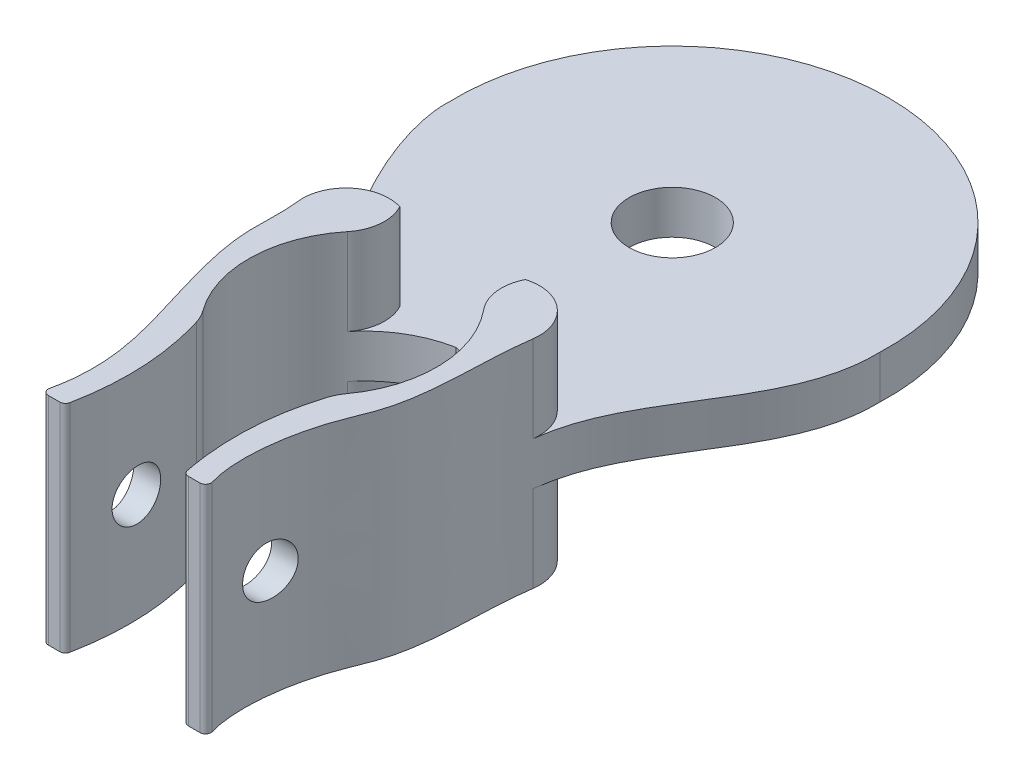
ISO-10303-21;
HEADER;
FILE_DESCRIPTION(('STEP AP214'),'2;1');
FILE_NAME('part.step','',(''),(''),'','','');
FILE_SCHEMA(('AUTOMOTIVE_DESIGN { 1 0 10303 214 1 1 1 1 }'));
ENDSEC;
DATA;
#1=APPLICATION_CONTEXT('core data for automotive mechanical design processes');
#2=APPLICATION_PROTOCOL_DEFINITION('international standard','automotive_design',2000,#1);
#3=PRODUCT_CONTEXT('',#1,'mechanical');
#4=PRODUCT('Part','Part','',(#3));
#5=PRODUCT_RELATED_PRODUCT_CATEGORY('part','',(#4));
#6=PRODUCT_DEFINITION_FORMATION('','',#4);
#7=PRODUCT_DEFINITION_CONTEXT('part definition',#1,'design');
#8=PRODUCT_DEFINITION('design','',#6,#7);
#9=PRODUCT_DEFINITION_SHAPE('','',#8);
#10=(LENGTH_UNIT() NAMED_UNIT(*) SI_UNIT(.MILLI.,.METRE.));
#11=(NAMED_UNIT(*) PLANE_ANGLE_UNIT() SI_UNIT($,.RADIAN.));
#12=(NAMED_UNIT(*) SI_UNIT($,.STERADIAN.) SOLID_ANGLE_UNIT());
#13=UNCERTAINTY_MEASURE_WITH_UNIT(LENGTH_MEASURE(1.E-05),#10,'distance_accuracy_value','');
#14=(GEOMETRIC_REPRESENTATION_CONTEXT(3) GLOBAL_UNCERTAINTY_ASSIGNED_CONTEXT((#13)) GLOBAL_UNIT_ASSIGNED_CONTEXT((#10,
#11,#12)) REPRESENTATION_CONTEXT('',''));
#15=CARTESIAN_POINT('',(0.,0.,0.));
#16=DIRECTION('',(0.,0.,1.));
#17=DIRECTION('',(1.,0.,0.));
#18=AXIS2_PLACEMENT_3D('',#15,#16,#17);
#19=CARTESIAN_POINT('',(-6.93411925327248,12.7,15.7482204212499));
#20=DIRECTION('',(0.,-1.,0.));
#21=DIRECTION('',(0.,0.,-1.));
#22=AXIS2_PLACEMENT_3D('',#19,#20,#21);
#23=PLANE('',#22);
#24=CARTESIAN_POINT('',(1.25597785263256,12.7,19.3588384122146));
#25=DIRECTION('',(0.,-1.,0.));
#26=DIRECTION('',(0.,0.,1.));
#27=AXIS2_PLACEMENT_3D('',#24,#25,#26);
#28=CIRCLE('',#27,6.77625334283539);
#29=CARTESIAN_POINT('',(-4.21241176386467,12.7,23.3606285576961));
#30=VERTEX_POINT('',#29);
#31=CARTESIAN_POINT('',(-3.99843270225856,12.7,15.0799624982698));
#32=VERTEX_POINT('',#31);
#33=EDGE_CURVE('E570',#30,#32,#28,.T.);
#34=ORIENTED_EDGE('',*,*,#33,.T.);
#35=CARTESIAN_POINT('',(-5.96798757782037,12.7,13.4760754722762));
#36=DIRECTION('',(0.,-1.,0.));
#37=DIRECTION('',(0.,0.,-1.));
#38=AXIS2_PLACEMENT_3D('',#35,#36,#37);
#39=CIRCLE('',#38,2.54);
#40=CARTESIAN_POINT('',(-3.73136641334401,12.7,12.2722790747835));
#41=VERTEX_POINT('',#40);
#42=EDGE_CURVE('E354',#32,#41,#39,.F.);
#43=ORIENTED_EDGE('',*,*,#42,.T.);
#44=CARTESIAN_POINT('',(-4.47025085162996,12.7,14.7024333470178));
#45=DIRECTION('',(0.,-1.,0.));
#46=DIRECTION('',(0.,0.,-1.));
#47=AXIS2_PLACEMENT_3D('',#44,#45,#46);
#48=CIRCLE('',#47,2.54);
#49=CARTESIAN_POINT('',(-6.99147324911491,12.7,15.0107150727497));
#50=VERTEX_POINT('',#49);
#51=EDGE_CURVE('E322',#41,#50,#48,.F.);
#52=ORIENTED_EDGE('',*,*,#51,.T.);
#53=CARTESIAN_POINT('',(-12.6900757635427,12.7,0.50197322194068));
#54=CARTESIAN_POINT('',(-12.7085946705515,12.7,0.534595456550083));
#55=CARTESIAN_POINT('',(-12.9445111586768,12.7,3.81873144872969));
#56=CARTESIAN_POINT('',(-6.44251711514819,12.7,13.8864500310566));
#57=CARTESIAN_POINT('',(-7.36026092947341,12.7,18.4591788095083));
#58=CARTESIAN_POINT('',(-5.27387900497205,12.7,24.7590934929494));
#59=CARTESIAN_POINT('',(-4.15604476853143,12.7,29.0328933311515));
#60=CARTESIAN_POINT('',(-4.77346849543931,12.7,31.7962230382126));
#61=B_SPLINE_CURVE_WITH_KNOTS('',3,(#53,#54,#55,#56,#57,#58,#59,#60),.UNSPECIFIED.,.F.,.F.,(4,1,
1,1,1,4),(0.,0.279659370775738,0.433863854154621,0.566787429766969,0.759908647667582,
0.988953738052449),.UNSPECIFIED.);
#62=CARTESIAN_POINT('',(-4.77346849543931,12.7,31.7962230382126));
#63=VERTEX_POINT('',#62);
#64=EDGE_CURVE('E416',#50,#63,#61,.T.);
#65=ORIENTED_EDGE('',*,*,#64,.T.);
#66=CARTESIAN_POINT('',(-4.45105676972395,12.7,31.8682610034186));
#67=DIRECTION('',(0.,1.,0.));
#68=DIRECTION('',(0.,0.,1.));
#69=AXIS2_PLACEMENT_3D('',#66,#67,#68);
#70=CIRCLE('',#69,0.330361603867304);
#71=CARTESIAN_POINT('',(-4.45105676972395,12.7,32.1986226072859));
#72=VERTEX_POINT('',#71);
#73=EDGE_CURVE('E421',#63,#72,#70,.T.);
#74=ORIENTED_EDGE('',*,*,#73,.T.);
#75=DIRECTION('',(1.,0.,0.));
#76=VECTOR('',#75,1.);
#77=CARTESIAN_POINT('',(-4.45105676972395,12.7,32.1986226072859));
#78=LINE('',#77,#76);
#79=CARTESIAN_POINT('',(-3.77597646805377,12.7,32.1986226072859));
#80=VERTEX_POINT('',#79);
#81=EDGE_CURVE('E679',#72,#80,#78,.T.);
#82=ORIENTED_EDGE('',*,*,#81,.T.);
#83=CARTESIAN_POINT('',(-3.77597646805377,12.7,31.8682610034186));
#84=DIRECTION('',(0.,1.,0.));
#85=DIRECTION('',(0.,0.,-1.));
#86=AXIS2_PLACEMENT_3D('',#83,#84,#85);
#87=CIRCLE('',#86,0.330361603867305);
#88=CARTESIAN_POINT('',(-3.45189480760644,12.7,31.932369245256));
#89=VERTEX_POINT('',#88);
#90=EDGE_CURVE('E674',#80,#89,#87,.T.);
#91=ORIENTED_EDGE('',*,*,#90,.T.);
#92=CARTESIAN_POINT('',(-3.45189480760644,12.7,31.932369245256));
#93=CARTESIAN_POINT('',(-3.03837590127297,12.7,29.8419376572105));
#94=CARTESIAN_POINT('',(-3.0285914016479,12.7,27.2020407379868));
#95=CARTESIAN_POINT('',(-3.6668448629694,12.7,24.6575247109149));
#96=CARTESIAN_POINT('',(-3.83488723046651,12.7,24.1124032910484));
#97=B_SPLINE_CURVE_WITH_KNOTS('',3,(#92,#93,#94,#95,#96),.UNSPECIFIED.,.F.,.F.,(4,1,4),
(0.0550755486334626,0.772138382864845,0.969570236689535),.UNSPECIFIED.);
#98=CARTESIAN_POINT('',(-3.83488723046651,12.7,24.1124032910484));
#99=VERTEX_POINT('',#98);
#100=EDGE_CURVE('E579',#89,#99,#97,.T.);
#101=ORIENTED_EDGE('',*,*,#100,.T.);
#102=CARTESIAN_POINT('',(-6.26217420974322,12.7,24.8606531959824));
#103=DIRECTION('',(0.,1.,0.));
#104=DIRECTION('',(0.,0.,-1.));
#105=AXIS2_PLACEMENT_3D('',#102,#103,#104);
#106=CIRCLE('',#105,2.54);
#107=EDGE_CURVE('E573',#99,#30,#106,.T.);
#108=ORIENTED_EDGE('',*,*,#107,.T.);
#109=EDGE_LOOP('',(#34,#43,#52,#65,#74,#82,#91,#101,#108));
#110=FACE_BOUND('',#109,.T.);
#111=ADVANCED_FACE('F33',(#110),#23,.F.);
#112=DIRECTION('',(0.,-1.,0.));
#113=VECTOR('',#112,1.);
#114=SURFACE_OF_LINEAR_EXTRUSION('',#61,#113);
#115=CARTESIAN_POINT('',(-4.82558670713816,6.33874814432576,26.7931185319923));
#116=CARTESIAN_POINT('',(-4.82558492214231,6.42033278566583,26.793124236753));
#117=CARTESIAN_POINT('',(-4.82413764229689,6.50199488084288,26.7999296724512));
#118=CARTESIAN_POINT('',(-4.81987433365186,6.62264488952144,26.8201527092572));
#119=CARTESIAN_POINT('',(-4.8181023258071,6.66258442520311,26.8285732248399));
#120=CARTESIAN_POINT('',(-4.81389040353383,6.74163263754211,26.848691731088));
#121=CARTESIAN_POINT('',(-4.8114499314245,6.78074059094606,26.8603924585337));
#122=CARTESIAN_POINT('',(-4.80319182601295,6.89620174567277,26.9002382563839));
#123=CARTESIAN_POINT('',(-4.7964301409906,6.97089350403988,26.9331609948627));
#124=CARTESIAN_POINT('',(-4.78081813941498,7.11366333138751,27.0107594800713));
#125=CARTESIAN_POINT('',(-4.77196749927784,7.18174037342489,27.055437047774));
#126=CARTESIAN_POINT('',(-4.75749274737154,7.27790124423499,27.1305384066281));
#127=CARTESIAN_POINT('',(-4.75243187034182,7.30914198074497,27.1571154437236));
#128=CARTESIAN_POINT('',(-4.74200305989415,7.36924575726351,27.2127210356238));
#129=CARTESIAN_POINT('',(-4.73663543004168,7.39811108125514,27.2417471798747));
#130=CARTESIAN_POINT('',(-4.72018166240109,7.48092125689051,27.3322746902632));
#131=CARTESIAN_POINT('',(-4.70874220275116,7.53109621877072,27.3972375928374));
#132=CARTESIAN_POINT('',(-4.68541309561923,7.6207538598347,27.5357592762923));
#133=CARTESIAN_POINT('',(-4.67351904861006,7.66002697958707,27.6094521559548));
#134=CARTESIAN_POINT('',(-4.65017062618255,7.72561050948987,27.7624764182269));
#135=CARTESIAN_POINT('',(-4.63871626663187,7.75192045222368,27.8418080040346));
#136=CARTESIAN_POINT('',(-4.6168266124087,7.79086413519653,28.0042461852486));
#137=CARTESIAN_POINT('',(-4.60639565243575,7.80344181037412,28.087366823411));
#138=CARTESIAN_POINT('',(-4.5871048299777,7.81428623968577,28.2547180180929));
#139=CARTESIAN_POINT('',(-4.57824485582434,7.81255401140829,28.3389484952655));
#140=CARTESIAN_POINT('',(-4.56249792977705,7.79483432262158,28.5051470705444));
#141=CARTESIAN_POINT('',(-4.55559050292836,7.77900262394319,28.5871298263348));
#142=CARTESIAN_POINT('',(-4.5437202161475,7.73367983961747,28.747375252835));
#143=CARTESIAN_POINT('',(-4.53875723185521,7.70418962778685,28.8256381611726));
#144=CARTESIAN_POINT('',(-4.53071113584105,7.63276624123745,28.9752845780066));
#145=CARTESIAN_POINT('',(-4.5276075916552,7.59097613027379,29.0467353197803));
#146=CARTESIAN_POINT('',(-4.5229149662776,7.49600770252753,29.1816737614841));
#147=CARTESIAN_POINT('',(-4.52132587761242,7.44282944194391,29.2451615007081));
#148=CARTESIAN_POINT('',(-4.51926683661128,7.32666810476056,29.3622776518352));
#149=CARTESIAN_POINT('',(-4.51879543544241,7.26369783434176,29.4159187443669));
#150=CARTESIAN_POINT('',(-4.51852290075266,7.12967945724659,29.5119271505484));
#151=CARTESIAN_POINT('',(-4.51872177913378,7.058631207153,29.5542942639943));
#152=CARTESIAN_POINT('',(-4.51936832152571,6.91018702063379,29.6266933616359));
#153=CARTESIAN_POINT('',(-4.51981688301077,6.83276904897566,29.6566801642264));
#154=CARTESIAN_POINT('',(-4.5206235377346,6.67400075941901,29.7032486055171));
#155=CARTESIAN_POINT('',(-4.52098163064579,6.59265042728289,29.7198301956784));
#156=CARTESIAN_POINT('',(-4.52140589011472,6.42821573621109,29.7391305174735));
#157=CARTESIAN_POINT('',(-4.52147168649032,6.34512931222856,29.741831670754));
#158=CARTESIAN_POINT('',(-4.52127643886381,6.17968257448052,29.7332466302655));
#159=CARTESIAN_POINT('',(-4.52101539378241,6.09732226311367,29.7219603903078));
#160=CARTESIAN_POINT('',(-4.52030635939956,5.93568349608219,29.6857253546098));
#161=CARTESIAN_POINT('',(-4.51985840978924,5.85640438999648,29.6607794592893));
#162=CARTESIAN_POINT('',(-4.51906827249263,5.70315677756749,29.5979342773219));
#163=CARTESIAN_POINT('',(-4.51872608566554,5.62918831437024,29.5600348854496));
#164=CARTESIAN_POINT('',(-4.51854970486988,5.48864603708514,29.4723476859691));
#165=CARTESIAN_POINT('',(-4.5187156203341,5.42207381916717,29.4225573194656));
#166=CARTESIAN_POINT('',(-4.52000681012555,5.2982388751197,29.3125114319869));
#167=CARTESIAN_POINT('',(-4.52113206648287,5.24097597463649,29.2522561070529));
#168=CARTESIAN_POINT('',(-4.52476638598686,5.13750194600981,29.1231472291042));
#169=CARTESIAN_POINT('',(-4.52727255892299,5.09126802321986,29.0543118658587));
#170=CARTESIAN_POINT('',(-4.53399785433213,5.01100774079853,28.9099369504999));
#171=CARTESIAN_POINT('',(-4.53821691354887,4.97698093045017,28.8343976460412));
#172=CARTESIAN_POINT('',(-4.54852645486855,4.92216214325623,28.6790688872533));
#173=CARTESIAN_POINT('',(-4.55461062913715,4.9013262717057,28.5992944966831));
#174=CARTESIAN_POINT('',(-4.56863752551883,4.87323250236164,28.4375515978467));
#175=CARTESIAN_POINT('',(-4.57658028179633,4.8659748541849,28.3555830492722));
#176=CARTESIAN_POINT('',(-4.59414033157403,4.86515659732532,28.1914516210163));
#177=CARTESIAN_POINT('',(-4.60376371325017,4.87164677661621,28.1092891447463));
#178=CARTESIAN_POINT('',(-4.62426122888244,4.89815341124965,27.9473475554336));
#179=CARTESIAN_POINT('',(-4.63513546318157,4.91817095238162,27.8675686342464));
#180=CARTESIAN_POINT('',(-4.65773923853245,4.97149088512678,27.7115209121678));
#181=CARTESIAN_POINT('',(-4.66947780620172,5.00495696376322,27.6353087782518));
#182=CARTESIAN_POINT('',(-4.68711859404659,5.06433461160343,27.5261080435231));
#183=CARTESIAN_POINT('',(-4.69300555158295,5.08566220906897,27.4905539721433));
#184=CARTESIAN_POINT('',(-4.70471364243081,5.13126305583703,27.4213230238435));
#185=CARTESIAN_POINT('',(-4.71053470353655,5.15553924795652,27.3876480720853));
#186=CARTESIAN_POINT('',(-4.72784906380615,5.23294253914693,27.2893352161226));
#187=CARTESIAN_POINT('',(-4.73910472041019,5.29035014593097,27.2279502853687));
#188=CARTESIAN_POINT('',(-4.76024674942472,5.41490186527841,27.1157314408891));
#189=CARTESIAN_POINT('',(-4.77013328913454,5.48204478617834,27.0648962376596));
#190=CARTESIAN_POINT('',(-4.78341597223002,5.58834173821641,26.99787333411));
#191=CARTESIAN_POINT('',(-4.78757552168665,5.62458779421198,26.977119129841));
#192=CARTESIAN_POINT('',(-4.7953278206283,5.69872042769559,26.938755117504));
#193=CARTESIAN_POINT('',(-4.79892106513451,5.73660553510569,26.9211425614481));
#194=CARTESIAN_POINT('',(-4.80875440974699,5.85232126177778,26.8732458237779));
#195=CARTESIAN_POINT('',(-4.81406360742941,5.93233438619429,26.8478256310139));
#196=CARTESIAN_POINT('',(-4.82046330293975,6.06713598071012,26.8173412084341));
#197=CARTESIAN_POINT('',(-4.82237864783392,6.12102978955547,26.8082730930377));
#198=CARTESIAN_POINT('',(-4.82494093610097,6.22952021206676,26.7961598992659));
#199=CARTESIAN_POINT('',(-4.82558790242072,6.28411681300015,26.7931147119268));
#200=CARTESIAN_POINT('',(-4.82558670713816,6.33874814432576,26.7931185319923));
#201=B_SPLINE_CURVE_WITH_KNOTS('',3,(#115,#116,#117,#118,#119,#120,#121,#122,#123,#124,#125,
#126,#127,#128,#129,#130,#131,#132,#133,#134,#135,#136,#137,#138,#139,#140,#141,#142,#143,#144,
#145,#146,#147,#148,#149,#150,#151,#152,#153,#154,#155,#156,#157,#158,#159,#160,#161,#162,#163,
#164,#165,#166,#167,#168,#169,#170,#171,#172,#173,#174,#175,#176,#177,#178,#179,#180,#181,#182,
#183,#184,#185,#186,#187,#188,#189,#190,#191,#192,#193,#194,#195,#196,#197,#198,#199,#200),
.UNSPECIFIED.,.T.,.F.,(4,2,2,2,2,2,2,2,2,2,2,2,2,2,2,2,2,2,2,2,2,2,2,2,2,2,2,2,2,2,2,2,2,2,2,2,
2,2,2,2,2,2,4),(0.,0.244519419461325,0.366967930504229,0.48951890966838,0.734016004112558,
0.978550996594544,1.10240700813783,1.22614250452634,1.47355319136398,1.72543392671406,
1.97732374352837,2.23023815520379,2.48313458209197,2.73327135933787,2.98339213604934,
3.23071149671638,3.47802963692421,3.72502700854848,3.97202876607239,4.21992414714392,
4.46782042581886,4.7160305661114,4.96424152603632,5.21239980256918,5.46056009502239,
5.70877383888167,5.95698293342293,6.20467449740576,6.4523569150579,6.69921074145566,
6.94606910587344,7.19384101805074,7.44163282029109,7.69253663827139,7.81803981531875,
7.94366929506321,8.19677100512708,8.44984176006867,8.5756267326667,8.70130113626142,
8.95222005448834,9.11595998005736,9.27969694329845),.UNSPECIFIED.);
#202=CARTESIAN_POINT('',(-4.82558670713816,6.33874814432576,26.7931185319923));
#203=VERTEX_POINT('',#202);
#204=EDGE_CURVE('E37',#203,#203,#201,.T.);
#205=ORIENTED_EDGE('',*,*,#204,.T.);
#206=EDGE_LOOP('',(#205));
#207=FACE_BOUND('',#206,.T.);
#208=CARTESIAN_POINT('',(-12.6900757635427,5.08,0.50197322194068));
#209=CARTESIAN_POINT('',(-12.7085946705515,5.08,0.534595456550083));
#210=CARTESIAN_POINT('',(-12.9445111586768,5.08,3.81873144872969));
#211=CARTESIAN_POINT('',(-6.44251711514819,5.08,13.8864500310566));
#212=CARTESIAN_POINT('',(-7.36026092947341,5.08,18.4591788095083));
#213=CARTESIAN_POINT('',(-5.27387900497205,5.08,24.7590934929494));
#214=CARTESIAN_POINT('',(-4.15604476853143,5.08,29.0328933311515));
#215=CARTESIAN_POINT('',(-4.77346849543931,5.08,31.7962230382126));
#216=B_SPLINE_CURVE_WITH_KNOTS('',3,(#208,#209,#210,#211,#212,#213,#214,#215),.UNSPECIFIED.,.F.,
.F.,(4,1,1,1,1,4),(0.,0.279659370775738,0.433863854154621,0.566787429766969,0.759908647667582,
0.988953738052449),.UNSPECIFIED.);
#217=CARTESIAN_POINT('',(-12.6900757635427,5.08,0.501973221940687));
#218=VERTEX_POINT('',#217);
#219=CARTESIAN_POINT('',(-6.99147324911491,5.08,15.0107150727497));
#220=VERTEX_POINT('',#219);
#221=EDGE_CURVE('E401',#218,#220,#216,.T.);
#222=ORIENTED_EDGE('',*,*,#221,.T.);
#223=DIRECTION('',(0.,-1.,0.));
#224=VECTOR('',#223,1.);
#225=CARTESIAN_POINT('',(-6.99147324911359,5.08,15.0107150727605));
#226=LINE('',#225,#224);
#227=CARTESIAN_POINT('',(-6.99147324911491,0.,15.0107150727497));
#228=VERTEX_POINT('',#227);
#229=EDGE_CURVE('E301',#220,#228,#226,.T.);
#230=ORIENTED_EDGE('',*,*,#229,.T.);
#231=CARTESIAN_POINT('',(-12.6900757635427,0.,0.50197322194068));
#232=CARTESIAN_POINT('',(-12.7085946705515,0.,0.534595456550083));
#233=CARTESIAN_POINT('',(-12.9445111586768,0.,3.81873144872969));
#234=CARTESIAN_POINT('',(-6.44251711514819,0.,13.8864500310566));
#235=CARTESIAN_POINT('',(-7.36026092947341,0.,18.4591788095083));
#236=CARTESIAN_POINT('',(-5.27387900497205,0.,24.7590934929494));
#237=CARTESIAN_POINT('',(-4.15604476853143,0.,29.0328933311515));
#238=CARTESIAN_POINT('',(-4.77346849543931,0.,31.7962230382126));
#239=B_SPLINE_CURVE_WITH_KNOTS('',3,(#231,#232,#233,#234,#235,#236,#237,#238),.UNSPECIFIED.,.F.,
.F.,(4,1,1,1,1,4),(0.,0.279659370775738,0.433863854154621,0.566787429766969,0.759908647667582,
0.988953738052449),.UNSPECIFIED.);
#240=CARTESIAN_POINT('',(-4.77346849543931,0.,31.7962230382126));
#241=VERTEX_POINT('',#240);
#242=EDGE_CURVE('E415',#228,#241,#239,.T.);
#243=ORIENTED_EDGE('',*,*,#242,.T.);
#244=DIRECTION('',(0.,-1.,0.));
#245=VECTOR('',#244,1.);
#246=CARTESIAN_POINT('',(-4.77346849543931,12.7,31.7962230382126));
#247=LINE('',#246,#245);
#248=EDGE_CURVE('E290',#63,#241,#247,.T.);
#249=ORIENTED_EDGE('',*,*,#248,.F.);
#250=ORIENTED_EDGE('',*,*,#64,.F.);
#251=DIRECTION('',(0.,-1.,0.));
#252=VECTOR('',#251,1.);
#253=CARTESIAN_POINT('',(-6.99147324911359,12.7,15.0107150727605));
#254=LINE('',#253,#252);
#255=CARTESIAN_POINT('',(-6.99147324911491,7.62,15.0107150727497));
#256=VERTEX_POINT('',#255);
#257=EDGE_CURVE('E235',#50,#256,#254,.T.);
#258=ORIENTED_EDGE('',*,*,#257,.T.);
#259=CARTESIAN_POINT('',(-12.6900757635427,7.62,0.50197322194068));
#260=CARTESIAN_POINT('',(-12.7085946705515,7.62,0.534595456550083));
#261=CARTESIAN_POINT('',(-12.9445111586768,7.62,3.81873144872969));
#262=CARTESIAN_POINT('',(-6.44251711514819,7.62,13.8864500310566));
#263=CARTESIAN_POINT('',(-7.36026092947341,7.62,18.4591788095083));
#264=CARTESIAN_POINT('',(-5.27387900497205,7.62,24.7590934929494));
#265=CARTESIAN_POINT('',(-4.15604476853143,7.62,29.0328933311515));
#266=CARTESIAN_POINT('',(-4.77346849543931,7.62,31.7962230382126));
#267=B_SPLINE_CURVE_WITH_KNOTS('',3,(#259,#260,#261,#262,#263,#264,#265,#266),.UNSPECIFIED.,.F.,
.F.,(4,1,1,1,1,4),(0.,0.279659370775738,0.433863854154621,0.566787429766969,0.759908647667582,
0.988953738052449),.UNSPECIFIED.);
#268=CARTESIAN_POINT('',(-12.6900757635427,7.62,0.501973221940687));
#269=VERTEX_POINT('',#268);
#270=EDGE_CURVE('E220',#269,#256,#267,.T.);
#271=ORIENTED_EDGE('',*,*,#270,.F.);
#272=DIRECTION('',(0.,-1.,0.));
#273=VECTOR('',#272,1.);
#274=CARTESIAN_POINT('',(-12.6900757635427,12.7,0.501973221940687));
#275=LINE('',#274,#273);
#276=EDGE_CURVE('E231',#269,#218,#275,.T.);
#277=ORIENTED_EDGE('',*,*,#276,.T.);
#278=EDGE_LOOP('',(#222,#230,#243,#249,#250,#258,#271,#277));
#279=FACE_BOUND('',#278,.T.);
#280=ADVANCED_FACE('F230',(#207,#279),#114,.F.);
#281=CARTESIAN_POINT('',(1.25597785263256,12.7,19.3588384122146));
#282=DIRECTION('',(0.,-1.,0.));
#283=DIRECTION('',(0.,0.,-1.));
#284=AXIS2_PLACEMENT_3D('',#281,#282,#283);
#285=CYLINDRICAL_SURFACE('',#284,6.77625334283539);
#286=CARTESIAN_POINT('',(1.25597785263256,0.,19.3588384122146));
#287=DIRECTION('',(0.,-1.,0.));
#288=DIRECTION('',(0.,0.,1.));
#289=AXIS2_PLACEMENT_3D('',#286,#287,#288);
#290=CIRCLE('',#289,6.77625334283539);
#291=CARTESIAN_POINT('',(-4.21241176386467,0.,23.3606285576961));
#292=VERTEX_POINT('',#291);
#293=CARTESIAN_POINT('',(-3.99843270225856,0.,15.0799624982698));
#294=VERTEX_POINT('',#293);
#295=EDGE_CURVE('E525',#292,#294,#290,.T.);
#296=ORIENTED_EDGE('',*,*,#295,.T.);
#297=DIRECTION('',(0.,-1.,0.));
#298=VECTOR('',#297,1.);
#299=CARTESIAN_POINT('',(-3.99843270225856,12.7,15.0799624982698));
#300=LINE('',#299,#298);
#301=CARTESIAN_POINT('',(-3.99843270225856,5.08,15.0799624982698));
#302=VERTEX_POINT('',#301);
#303=EDGE_CURVE('E341',#294,#302,#300,.F.);
#304=ORIENTED_EDGE('',*,*,#303,.T.);
#305=CARTESIAN_POINT('',(1.25597785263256,5.08,19.3588384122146));
#306=DIRECTION('',(0.,1.,0.));
#307=DIRECTION('',(0.,0.,1.));
#308=AXIS2_PLACEMENT_3D('',#305,#306,#307);
#309=CIRCLE('',#308,6.77625334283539);
#310=CARTESIAN_POINT('',(0.,5.08,12.7));
#311=VERTEX_POINT('',#310);
#312=EDGE_CURVE('E412',#302,#311,#309,.F.);
#313=ORIENTED_EDGE('',*,*,#312,.T.);
#314=DIRECTION('',(0.,-1.,0.));
#315=VECTOR('',#314,1.);
#316=CARTESIAN_POINT('',(0.,12.7,12.7));
#317=LINE('',#316,#315);
#318=CARTESIAN_POINT('',(0.,7.62,12.7));
#319=VERTEX_POINT('',#318);
#320=EDGE_CURVE('E273',#319,#311,#317,.T.);
#321=ORIENTED_EDGE('',*,*,#320,.F.);
#322=CARTESIAN_POINT('',(1.25597785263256,7.62,19.3588384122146));
#323=DIRECTION('',(0.,1.,0.));
#324=DIRECTION('',(0.,0.,1.));
#325=AXIS2_PLACEMENT_3D('',#322,#323,#324);
#326=CIRCLE('',#325,6.77625334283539);
#327=CARTESIAN_POINT('',(-3.99843270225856,7.62,15.0799624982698));
#328=VERTEX_POINT('',#327);
#329=EDGE_CURVE('E296',#328,#319,#326,.F.);
#330=ORIENTED_EDGE('',*,*,#329,.F.);
#331=DIRECTION('',(0.,-1.,0.));
#332=VECTOR('',#331,1.);
#333=CARTESIAN_POINT('',(-3.99843270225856,12.7,15.0799624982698));
#334=LINE('',#333,#332);
#335=EDGE_CURVE('E339',#328,#32,#334,.F.);
#336=ORIENTED_EDGE('',*,*,#335,.T.);
#337=ORIENTED_EDGE('',*,*,#33,.F.);
#338=DIRECTION('',(0.,-1.,0.));
#339=VECTOR('',#338,1.);
#340=CARTESIAN_POINT('',(-4.21241176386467,12.7,23.3606285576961));
#341=LINE('',#340,#339);
#342=EDGE_CURVE('E275',#30,#292,#341,.T.);
#343=ORIENTED_EDGE('',*,*,#342,.T.);
#344=EDGE_LOOP('',(#296,#304,#313,#321,#330,#336,#337,#343));
#345=FACE_BOUND('',#344,.T.);
#346=ADVANCED_FACE('F430',(#345),#285,.F.);
#347=CARTESIAN_POINT('',(-1.25597785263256,12.7,19.3588384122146));
#348=DIRECTION('',(0.,-1.,0.));
#349=DIRECTION('',(0.,0.,-1.));
#350=AXIS2_PLACEMENT_3D('',#347,#348,#349);
#351=CYLINDRICAL_SURFACE('',#350,6.77625334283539);
#352=CARTESIAN_POINT('',(-1.25597785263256,5.08,19.3588384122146));
#353=DIRECTION('',(0.,1.,0.));
#354=DIRECTION('',(0.,0.,1.));
#355=AXIS2_PLACEMENT_3D('',#352,#353,#354);
#356=CIRCLE('',#355,6.77625334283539);
#357=CARTESIAN_POINT('',(3.97241342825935,5.08,15.0482080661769));
#358=VERTEX_POINT('',#357);
#359=EDGE_CURVE('E53',#311,#358,#356,.F.);
#360=ORIENTED_EDGE('',*,*,#359,.T.);
#361=DIRECTION('',(0.,-1.,0.));
#362=VECTOR('',#361,1.);
#363=CARTESIAN_POINT('',(3.97241342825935,12.7,15.0482080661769));
#364=LINE('',#363,#362);
#365=CARTESIAN_POINT('',(3.97241342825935,0.,15.0482080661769));
#366=VERTEX_POINT('',#365);
#367=EDGE_CURVE('E348',#358,#366,#364,.T.);
#368=ORIENTED_EDGE('',*,*,#367,.T.);
#369=CARTESIAN_POINT('',(-1.25597785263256,0.,19.3588384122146));
#370=DIRECTION('',(0.,-1.,0.));
#371=DIRECTION('',(0.,0.,-1.));
#372=AXIS2_PLACEMENT_3D('',#369,#370,#371);
#373=CIRCLE('',#372,6.77625334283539);
#374=CARTESIAN_POINT('',(4.21241176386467,0.,23.3606285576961));
#375=VERTEX_POINT('',#374);
#376=EDGE_CURVE('E528',#366,#375,#373,.T.);
#377=ORIENTED_EDGE('',*,*,#376,.T.);
#378=DIRECTION('',(0.,-1.,0.));
#379=VECTOR('',#378,1.);
#380=CARTESIAN_POINT('',(4.21241176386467,12.7,23.3606285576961));
#381=LINE('',#380,#379);
#382=CARTESIAN_POINT('',(4.21241176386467,12.7,23.3606285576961));
#383=VERTEX_POINT('',#382);
#384=EDGE_CURVE('E270',#383,#375,#381,.T.);
#385=ORIENTED_EDGE('',*,*,#384,.F.);
#386=CARTESIAN_POINT('',(-1.25597785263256,12.7,19.3588384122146));
#387=DIRECTION('',(0.,-1.,0.));
#388=DIRECTION('',(0.,0.,-1.));
#389=AXIS2_PLACEMENT_3D('',#386,#387,#388);
#390=CIRCLE('',#389,6.77625334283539);
#391=CARTESIAN_POINT('',(3.97241342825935,12.7,15.0482080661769));
#392=VERTEX_POINT('',#391);
#393=EDGE_CURVE('E575',#392,#383,#390,.T.);
#394=ORIENTED_EDGE('',*,*,#393,.F.);
#395=DIRECTION('',(0.,-1.,0.));
#396=VECTOR('',#395,1.);
#397=CARTESIAN_POINT('',(3.97241342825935,12.7,15.0482080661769));
#398=LINE('',#397,#396);
#399=CARTESIAN_POINT('',(3.97241342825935,7.62,15.0482080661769));
#400=VERTEX_POINT('',#399);
#401=EDGE_CURVE('E346',#392,#400,#398,.T.);
#402=ORIENTED_EDGE('',*,*,#401,.T.);
#403=CARTESIAN_POINT('',(-1.25597785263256,7.62,19.3588384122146));
#404=DIRECTION('',(0.,1.,0.));
#405=DIRECTION('',(0.,0.,1.));
#406=AXIS2_PLACEMENT_3D('',#403,#404,#405);
#407=CIRCLE('',#406,6.77625334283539);
#408=EDGE_CURVE('E61',#319,#400,#407,.F.);
#409=ORIENTED_EDGE('',*,*,#408,.F.);
#410=ORIENTED_EDGE('',*,*,#320,.T.);
#411=EDGE_LOOP('',(#360,#368,#377,#385,#394,#402,#409,#410));
#412=FACE_BOUND('',#411,.T.);
#413=ADVANCED_FACE('F490',(#412),#351,.F.);
#414=CARTESIAN_POINT('',(4.77346849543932,12.7,31.7962230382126));
#415=CARTESIAN_POINT('',(4.26261652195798,12.7,30.1479997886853));
#416=CARTESIAN_POINT('',(4.52523901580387,12.7,26.6602313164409));
#417=CARTESIAN_POINT('',(7.08560364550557,12.7,20.9954102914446));
#418=CARTESIAN_POINT('',(5.48854782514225,12.7,11.2875043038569));
#419=CARTESIAN_POINT('',(12.8342449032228,12.7,5.63803468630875));
#420=CARTESIAN_POINT('',(12.6900757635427,12.7,0.501973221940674));
#421=B_SPLINE_CURVE_WITH_KNOTS('',3,(#414,#415,#416,#417,#418,#419,#420),.UNSPECIFIED.,.F.,.F.,
(4,1,1,1,4),(0.,0.239032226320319,0.296991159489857,0.579589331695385,1.),.UNSPECIFIED.);
#422=DIRECTION('',(0.,-1.,0.));
#423=VECTOR('',#422,1.);
#424=SURFACE_OF_LINEAR_EXTRUSION('',#421,#423);
#425=CARTESIAN_POINT('',(4.82222308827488,6.33874814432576,26.7931185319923));
#426=CARTESIAN_POINT('',(4.82222113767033,6.25719314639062,26.7931242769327));
#427=CARTESIAN_POINT('',(4.82074264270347,6.17555936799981,26.7999249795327));
#428=CARTESIAN_POINT('',(4.81639468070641,6.05495256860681,26.8201332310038));
#429=CARTESIAN_POINT('',(4.81458806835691,6.01502702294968,26.8285477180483));
#430=CARTESIAN_POINT('',(4.8102978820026,5.93600703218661,26.848651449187));
#431=CARTESIAN_POINT('',(4.80781374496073,5.89691330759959,26.8603434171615));
#432=CARTESIAN_POINT('',(4.79941744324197,5.78149842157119,26.9001572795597));
#433=CARTESIAN_POINT('',(4.79255369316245,5.70683823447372,26.9330518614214));
#434=CARTESIAN_POINT('',(4.77675153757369,5.56412355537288,27.0105827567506));
#435=CARTESIAN_POINT('',(4.7678127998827,5.49607012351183,27.0552209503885));
#436=CARTESIAN_POINT('',(4.75322908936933,5.39991273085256,27.1302755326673));
#437=CARTESIAN_POINT('',(4.74813373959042,5.3686584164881,27.1568491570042));
#438=CARTESIAN_POINT('',(4.73764520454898,5.30852712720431,27.2124502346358));
#439=CARTESIAN_POINT('',(4.73225231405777,5.2796478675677,27.2414752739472));
#440=CARTESIAN_POINT('',(4.71573605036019,5.19679590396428,27.3320030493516));
#441=CARTESIAN_POINT('',(4.70427257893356,5.14659282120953,27.3969711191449));
#442=CARTESIAN_POINT('',(4.68090432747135,5.05688266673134,27.5355107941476));
#443=CARTESIAN_POINT('',(4.66899531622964,5.01758520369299,27.6092166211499));
#444=CARTESIAN_POINT('',(4.64557412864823,4.95196107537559,27.7622659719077));
#445=CARTESIAN_POINT('',(4.63406196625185,4.92563486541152,27.8416096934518));
#446=CARTESIAN_POINT('',(4.61195212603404,4.88666627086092,28.0040558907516));
#447=CARTESIAN_POINT('',(4.60135828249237,4.874078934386,28.0871721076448));
#448=CARTESIAN_POINT('',(4.58158217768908,4.86321221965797,28.2545023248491));
#449=CARTESIAN_POINT('',(4.57239983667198,4.86493203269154,28.3387162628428));
#450=CARTESIAN_POINT('',(4.55581702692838,4.88263187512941,28.504999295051));
#451=CARTESIAN_POINT('',(4.54840054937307,4.89847707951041,28.5870811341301));
#452=CARTESIAN_POINT('',(4.53535437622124,4.9438592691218,28.7475166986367));
#453=CARTESIAN_POINT('',(4.52972457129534,4.97339541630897,28.8258706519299));
#454=CARTESIAN_POINT('',(4.52024565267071,5.04497041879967,28.9757419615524));
#455=CARTESIAN_POINT('',(4.51637845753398,5.0868747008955,29.0473224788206));
#456=CARTESIAN_POINT('',(4.51013399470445,5.18212274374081,29.1824905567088));
#457=CARTESIAN_POINT('',(4.50775670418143,5.2354663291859,29.2460782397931));
#458=CARTESIAN_POINT('',(4.50417911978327,5.35191396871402,29.3632600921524));
#459=CARTESIAN_POINT('',(4.5029755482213,5.41499026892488,29.4168817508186));
#460=CARTESIAN_POINT('',(4.5013574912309,5.54922785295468,29.5128266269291));
#461=CARTESIAN_POINT('',(4.50094301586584,5.62038923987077,29.5551497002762));
#462=CARTESIAN_POINT('',(4.50052812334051,5.76896787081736,29.6273874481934));
#463=CARTESIAN_POINT('',(4.50052870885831,5.8463998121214,29.657271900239));
#464=CARTESIAN_POINT('',(4.50063571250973,6.00517737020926,29.7036385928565));
#465=CARTESIAN_POINT('',(4.50074213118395,6.08652300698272,29.7201207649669));
#466=CARTESIAN_POINT('',(4.50087252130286,6.25095005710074,29.7392306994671));
#467=CARTESIAN_POINT('',(4.50089636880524,6.33403389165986,29.7418376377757));
#468=CARTESIAN_POINT('',(4.50083021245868,6.49946028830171,29.7330668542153));
#469=CARTESIAN_POINT('',(4.50074020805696,6.58180284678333,29.7216890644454));
#470=CARTESIAN_POINT('',(4.50057947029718,6.74341379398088,29.6852707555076));
#471=CARTESIAN_POINT('',(4.50050873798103,6.82268201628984,29.6602294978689));
#472=CARTESIAN_POINT('',(4.50065888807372,6.97588968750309,29.5971943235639));
#473=CARTESIAN_POINT('',(4.50087977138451,7.04982911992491,29.5592003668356));
#474=CARTESIAN_POINT('',(4.50197487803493,7.19026417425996,29.4713485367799));
#475=CARTESIAN_POINT('',(4.50284898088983,7.25676116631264,29.4214928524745));
#476=CARTESIAN_POINT('',(4.50563797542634,7.38043155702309,29.311340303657));
#477=CARTESIAN_POINT('',(4.50755284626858,7.4376051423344,29.2510436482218));
#478=CARTESIAN_POINT('',(4.51276590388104,7.54089324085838,29.1218820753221));
#479=CARTESIAN_POINT('',(4.51606121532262,7.58703042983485,29.0530351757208));
#480=CARTESIAN_POINT('',(4.52428416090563,7.66710013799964,28.9086675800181));
#481=CARTESIAN_POINT('',(4.52921175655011,7.70103294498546,28.8331470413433));
#482=CARTESIAN_POINT('',(4.54080017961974,7.75571974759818,28.6777572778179));
#483=CARTESIAN_POINT('',(4.54745788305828,7.77649726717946,28.5978960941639));
#484=CARTESIAN_POINT('',(4.56246184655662,7.80445002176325,28.4359846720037));
#485=CARTESIAN_POINT('',(4.5708081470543,7.81162493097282,28.3539343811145));
#486=CARTESIAN_POINT('',(4.58902323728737,7.81225141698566,28.189549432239));
#487=CARTESIAN_POINT('',(4.59889919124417,7.80563649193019,28.107215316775));
#488=CARTESIAN_POINT('',(4.61977743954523,7.77882013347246,27.9449484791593));
#489=CARTESIAN_POINT('',(4.63077981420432,7.75861773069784,27.8650159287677));
#490=CARTESIAN_POINT('',(4.65355700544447,7.70489900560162,27.7087865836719));
#491=CARTESIAN_POINT('',(4.66533919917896,7.67123350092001,27.6325416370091));
#492=CARTESIAN_POINT('',(4.68303067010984,7.61154207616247,27.5233234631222));
#493=CARTESIAN_POINT('',(4.68893205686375,7.59010745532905,27.4877689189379));
#494=CARTESIAN_POINT('',(4.70066917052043,7.54428897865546,27.4185487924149));
#495=CARTESIAN_POINT('',(4.70650482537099,7.51990217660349,27.3848851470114));
#496=CARTESIAN_POINT('',(4.72385555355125,7.44222657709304,27.2867068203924));
#497=CARTESIAN_POINT('',(4.73514052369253,7.38466830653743,27.22545414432));
#498=CARTESIAN_POINT('',(4.75637404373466,7.25984209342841,27.1135265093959));
#499=CARTESIAN_POINT('',(4.76632275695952,7.1925753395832,27.0628502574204));
#500=CARTESIAN_POINT('',(4.77971165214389,7.08610740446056,26.9960752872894));
#501=CARTESIAN_POINT('',(4.78390897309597,7.04980310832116,26.9754034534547));
#502=CARTESIAN_POINT('',(4.79173663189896,6.97556040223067,26.9372093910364));
#503=CARTESIAN_POINT('',(4.79536746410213,6.93762345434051,26.919684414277));
#504=CARTESIAN_POINT('',(4.80530643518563,6.82176396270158,26.8720583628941));
#505=CARTESIAN_POINT('',(4.81067699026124,6.74166808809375,26.8468280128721));
#506=CARTESIAN_POINT('',(4.81710620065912,6.60736409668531,26.8168055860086));
#507=CARTESIAN_POINT('',(4.81901869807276,6.55405630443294,26.807937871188));
#508=CARTESIAN_POINT('',(4.82157777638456,6.44675990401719,26.7960924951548));
#509=CARTESIAN_POINT('',(4.82222438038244,6.39277130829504,26.7931147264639));
#510=CARTESIAN_POINT('',(4.82222308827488,6.33874814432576,26.7931185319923));
#511=B_SPLINE_CURVE_WITH_KNOTS('',3,(#425,#426,#427,#428,#429,#430,#431,#432,#433,#434,#435,
#436,#437,#438,#439,#440,#441,#442,#443,#444,#445,#446,#447,#448,#449,#450,#451,#452,#453,#454,
#455,#456,#457,#458,#459,#460,#461,#462,#463,#464,#465,#466,#467,#468,#469,#470,#471,#472,#473,
#474,#475,#476,#477,#478,#479,#480,#481,#482,#483,#484,#485,#486,#487,#488,#489,#490,#491,#492,
#493,#494,#495,#496,#497,#498,#499,#500,#501,#502,#503,#504,#505,#506,#507,#508,#509,#510),
.UNSPECIFIED.,.T.,.F.,(4,2,2,2,2,2,2,2,2,2,2,2,2,2,2,2,2,2,2,2,2,2,2,2,2,2,2,2,2,2,2,2,2,2,2,2,
2,2,2,2,2,2,4),(0.,0.244432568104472,0.366841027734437,0.489351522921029,0.733755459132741,
0.97819854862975,1.10209144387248,1.22586372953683,1.47334691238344,1.72530091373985,
1.97726375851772,2.23023248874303,2.48318691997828,2.73375248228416,2.98430270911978,
3.23222142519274,3.48013634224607,3.72735694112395,3.97458069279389,4.22240167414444,
4.47022392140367,4.7184179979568,4.96661327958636,5.21482197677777,5.46303144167,
5.7111951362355,5.95935386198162,6.20699824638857,6.45463679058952,6.70183125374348,
6.94903163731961,7.19742690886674,7.44583990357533,7.69708537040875,7.82275913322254,
7.94855936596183,8.20169248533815,8.45479463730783,8.58061981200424,8.70633456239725,
8.95732568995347,9.1192441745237,9.2811597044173),.UNSPECIFIED.);
#512=CARTESIAN_POINT('',(4.82222308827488,6.33874814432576,26.7931185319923));
#513=VERTEX_POINT('',#512);
#514=EDGE_CURVE('E608',#513,#513,#511,.T.);
#515=ORIENTED_EDGE('',*,*,#514,.T.);
#516=EDGE_LOOP('',(#515));
#517=FACE_BOUND('',#516,.T.);
#518=CARTESIAN_POINT('',(4.77346849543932,0.,31.7962230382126));
#519=CARTESIAN_POINT('',(4.26261652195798,0.,30.1479997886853));
#520=CARTESIAN_POINT('',(4.52523901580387,0.,26.6602313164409));
#521=CARTESIAN_POINT('',(7.08560364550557,0.,20.9954102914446));
#522=CARTESIAN_POINT('',(5.48854782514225,0.,11.2875043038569));
#523=CARTESIAN_POINT('',(12.8342449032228,0.,5.63803468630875));
#524=CARTESIAN_POINT('',(12.6900757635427,0.,0.501973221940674));
#525=B_SPLINE_CURVE_WITH_KNOTS('',3,(#518,#519,#520,#521,#522,#523,#524),.UNSPECIFIED.,.F.,.F.,
(4,1,1,1,4),(0.,0.239032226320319,0.296991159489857,0.579589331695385,1.),.UNSPECIFIED.);
#526=CARTESIAN_POINT('',(4.77346849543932,0.,31.7962230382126));
#527=VERTEX_POINT('',#526);
#528=CARTESIAN_POINT('',(6.90221502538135,0.,15.0828782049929));
#529=VERTEX_POINT('',#528);
#530=EDGE_CURVE('E251',#527,#529,#525,.T.);
#531=ORIENTED_EDGE('',*,*,#530,.T.);
#532=DIRECTION('',(0.,-1.,0.));
#533=VECTOR('',#532,1.);
#534=CARTESIAN_POINT('',(6.90221502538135,0.,15.0828782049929));
#535=LINE('',#534,#533);
#536=CARTESIAN_POINT('',(6.90221502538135,5.08,15.0828782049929));
#537=VERTEX_POINT('',#536);
#538=EDGE_CURVE('E311',#529,#537,#535,.F.);
#539=ORIENTED_EDGE('',*,*,#538,.T.);
#540=CARTESIAN_POINT('',(4.77346849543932,5.08,31.7962230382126));
#541=CARTESIAN_POINT('',(4.26261652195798,5.08,30.1479997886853));
#542=CARTESIAN_POINT('',(4.52523901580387,5.08,26.6602313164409));
#543=CARTESIAN_POINT('',(7.08560364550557,5.08,20.9954102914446));
#544=CARTESIAN_POINT('',(5.48854782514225,5.08,11.2875043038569));
#545=CARTESIAN_POINT('',(12.8342449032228,5.08,5.63803468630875));
#546=CARTESIAN_POINT('',(12.6900757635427,5.08,0.501973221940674));
#547=B_SPLINE_CURVE_WITH_KNOTS('',3,(#540,#541,#542,#543,#544,#545,#546),.UNSPECIFIED.,.F.,.F.,
(4,1,1,1,4),(0.,0.239032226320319,0.296991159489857,0.579589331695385,1.),.UNSPECIFIED.);
#548=CARTESIAN_POINT('',(12.6900757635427,5.08,0.501973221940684));
#549=VERTEX_POINT('',#548);
#550=EDGE_CURVE('E397',#537,#549,#547,.T.);
#551=ORIENTED_EDGE('',*,*,#550,.T.);
#552=DIRECTION('',(0.,-1.,0.));
#553=VECTOR('',#552,1.);
#554=CARTESIAN_POINT('',(12.6900757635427,12.7,0.501973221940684));
#555=LINE('',#554,#553);
#556=CARTESIAN_POINT('',(12.6900757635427,7.62,0.501973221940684));
#557=VERTEX_POINT('',#556);
#558=EDGE_CURVE('E242',#557,#549,#555,.T.);
#559=ORIENTED_EDGE('',*,*,#558,.F.);
#560=CARTESIAN_POINT('',(4.77346849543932,7.62,31.7962230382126));
#561=CARTESIAN_POINT('',(4.26261652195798,7.62,30.1479997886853));
#562=CARTESIAN_POINT('',(4.52523901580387,7.62,26.6602313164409));
#563=CARTESIAN_POINT('',(7.08560364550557,7.62,20.9954102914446));
#564=CARTESIAN_POINT('',(5.48854782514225,7.62,11.2875043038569));
#565=CARTESIAN_POINT('',(12.8342449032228,7.62,5.63803468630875));
#566=CARTESIAN_POINT('',(12.6900757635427,7.62,0.501973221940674));
#567=B_SPLINE_CURVE_WITH_KNOTS('',3,(#560,#561,#562,#563,#564,#565,#566),.UNSPECIFIED.,.F.,.F.,
(4,1,1,1,4),(0.,0.239032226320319,0.296991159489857,0.579589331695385,1.),.UNSPECIFIED.);
#568=CARTESIAN_POINT('',(6.90221502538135,7.62,15.0828782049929));
#569=VERTEX_POINT('',#568);
#570=EDGE_CURVE('E223',#569,#557,#567,.T.);
#571=ORIENTED_EDGE('',*,*,#570,.F.);
#572=DIRECTION('',(0.,-1.,0.));
#573=VECTOR('',#572,1.);
#574=CARTESIAN_POINT('',(6.90221502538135,7.62,15.0828782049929));
#575=LINE('',#574,#573);
#576=CARTESIAN_POINT('',(6.90221502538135,12.7,15.0828782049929));
#577=VERTEX_POINT('',#576);
#578=EDGE_CURVE('E309',#569,#577,#575,.F.);
#579=ORIENTED_EDGE('',*,*,#578,.T.);
#580=CARTESIAN_POINT('',(4.77346849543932,12.7,31.7962230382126));
#581=VERTEX_POINT('',#580);
#582=EDGE_CURVE('E243',#581,#577,#421,.T.);
#583=ORIENTED_EDGE('',*,*,#582,.F.);
#584=DIRECTION('',(0.,-1.,0.));
#585=VECTOR('',#584,1.);
#586=CARTESIAN_POINT('',(4.77346849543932,12.7,31.7962230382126));
#587=LINE('',#586,#585);
#588=EDGE_CURVE('E245',#581,#527,#587,.T.);
#589=ORIENTED_EDGE('',*,*,#588,.T.);
#590=EDGE_LOOP('',(#531,#539,#551,#559,#571,#579,#583,#589));
#591=FACE_BOUND('',#590,.T.);
#592=ADVANCED_FACE('F378',(#517,#591),#424,.F.);
#593=CARTESIAN_POINT('',(0.,12.7,0.));
#594=DIRECTION('',(0.,-1.,0.));
#595=DIRECTION('',(0.,0.,-1.));
#596=AXIS2_PLACEMENT_3D('',#593,#594,#595);
#597=CYLINDRICAL_SURFACE('',#596,12.7);
#598=CARTESIAN_POINT('',(0.,7.62,0.));
#599=DIRECTION('',(0.,1.,0.));
#600=DIRECTION('',(0.,0.,1.));
#601=AXIS2_PLACEMENT_3D('',#598,#599,#600);
#602=CIRCLE('',#601,12.7);
#603=EDGE_CURVE('E216',#557,#269,#602,.T.);
#604=ORIENTED_EDGE('',*,*,#603,.F.);
#605=ORIENTED_EDGE('',*,*,#558,.T.);
#606=CARTESIAN_POINT('',(0.,5.08,0.));
#607=DIRECTION('',(0.,1.,0.));
#608=DIRECTION('',(0.,0.,1.));
#609=AXIS2_PLACEMENT_3D('',#606,#607,#608);
#610=CIRCLE('',#609,12.7);
#611=EDGE_CURVE('E241',#549,#218,#610,.T.);
#612=ORIENTED_EDGE('',*,*,#611,.T.);
#613=ORIENTED_EDGE('',*,*,#276,.F.);
#614=EDGE_LOOP('',(#604,#605,#612,#613));
#615=FACE_BOUND('',#614,.T.);
#616=ADVANCED_FACE('F239',(#615),#597,.T.);
#617=CARTESIAN_POINT('',(0.,12.7,0.));
#618=DIRECTION('',(0.,-1.,0.));
#619=DIRECTION('',(0.,0.,-1.));
#620=AXIS2_PLACEMENT_3D('',#617,#618,#619);
#621=CYLINDRICAL_SURFACE('',#620,2.54);
#622=CARTESIAN_POINT('',(0.,5.08,0.));
#623=DIRECTION('',(0.,1.,0.));
#624=DIRECTION('',(0.,0.,1.));
#625=AXIS2_PLACEMENT_3D('',#622,#623,#624);
#626=CIRCLE('',#625,2.54);
#627=CARTESIAN_POINT('',(0.,5.08,2.54));
#628=VERTEX_POINT('',#627);
#629=EDGE_CURVE('E293',#628,#628,#626,.T.);
#630=ORIENTED_EDGE('',*,*,#629,.F.);
#631=EDGE_LOOP('',(#630));
#632=FACE_BOUND('',#631,.T.);
#633=CARTESIAN_POINT('',(0.,7.62,0.));
#634=DIRECTION('',(0.,1.,0.));
#635=DIRECTION('',(0.,0.,1.));
#636=AXIS2_PLACEMENT_3D('',#633,#634,#635);
#637=CIRCLE('',#636,2.54);
#638=CARTESIAN_POINT('',(0.,7.62,2.54));
#639=VERTEX_POINT('',#638);
#640=EDGE_CURVE('E227',#639,#639,#637,.T.);
#641=ORIENTED_EDGE('',*,*,#640,.T.);
#642=EDGE_LOOP('',(#641));
#643=FACE_BOUND('',#642,.T.);
#644=ADVANCED_FACE('F477',(#632,#643),#621,.F.);
#645=CARTESIAN_POINT('',(-6.93411925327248,0.,15.7482204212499));
#646=DIRECTION('',(0.,-1.,0.));
#647=DIRECTION('',(0.,0.,-1.));
#648=AXIS2_PLACEMENT_3D('',#645,#646,#647);
#649=PLANE('',#648);
#650=ORIENTED_EDGE('',*,*,#376,.F.);
#651=CARTESIAN_POINT('',(5.93221528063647,0.,13.4324182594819));
#652=DIRECTION('',(0.,-1.,0.));
#653=DIRECTION('',(0.,0.,-1.));
#654=AXIS2_PLACEMENT_3D('',#651,#652,#653);
#655=CIRCLE('',#654,2.54);
#656=CARTESIAN_POINT('',(3.66205072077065,0.,12.293140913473));
#657=VERTEX_POINT('',#656);
#658=EDGE_CURVE('E350',#366,#657,#655,.T.);
#659=ORIENTED_EDGE('',*,*,#658,.T.);
#660=CARTESIAN_POINT('',(4.38720927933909,0.,14.7274262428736));
#661=DIRECTION('',(0.,-1.,0.));
#662=DIRECTION('',(0.,0.,-1.));
#663=AXIS2_PLACEMENT_3D('',#660,#661,#662);
#664=CIRCLE('',#663,2.54);
#665=EDGE_CURVE('E317',#657,#529,#664,.T.);
#666=ORIENTED_EDGE('',*,*,#665,.T.);
#667=ORIENTED_EDGE('',*,*,#530,.F.);
#668=CARTESIAN_POINT('',(4.45105676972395,0.,31.8682610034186));
#669=DIRECTION('',(0.,1.,0.));
#670=DIRECTION('',(0.,0.,-1.));
#671=AXIS2_PLACEMENT_3D('',#668,#669,#670);
#672=CIRCLE('',#671,0.330361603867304);
#673=CARTESIAN_POINT('',(4.45105676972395,0.,32.1986226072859));
#674=VERTEX_POINT('',#673);
#675=EDGE_CURVE('E542',#674,#527,#672,.T.);
#676=ORIENTED_EDGE('',*,*,#675,.F.);
#677=DIRECTION('',(1.,0.,0.));
#678=VECTOR('',#677,1.);
#679=CARTESIAN_POINT('',(4.45105676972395,0.,32.1986226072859));
#680=LINE('',#679,#678);
#681=CARTESIAN_POINT('',(3.77597646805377,0.,32.1986226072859));
#682=VERTEX_POINT('',#681);
#683=EDGE_CURVE('E541',#682,#674,#680,.T.);
#684=ORIENTED_EDGE('',*,*,#683,.F.);
#685=CARTESIAN_POINT('',(3.77597646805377,0.,31.8682610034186));
#686=DIRECTION('',(0.,1.,0.));
#687=DIRECTION('',(0.,0.,1.));
#688=AXIS2_PLACEMENT_3D('',#685,#686,#687);
#689=CIRCLE('',#688,0.330361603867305);
#690=CARTESIAN_POINT('',(3.45189480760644,0.,31.932369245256));
#691=VERTEX_POINT('',#690);
#692=EDGE_CURVE('E536',#691,#682,#689,.T.);
#693=ORIENTED_EDGE('',*,*,#692,.F.);
#694=CARTESIAN_POINT('',(3.83488723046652,0.,24.1124032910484));
#695=CARTESIAN_POINT('',(3.66684486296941,0.,24.6575247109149));
#696=CARTESIAN_POINT('',(3.02859140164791,0.,27.2020407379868));
#697=CARTESIAN_POINT('',(3.03837590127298,0.,29.8419376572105));
#698=CARTESIAN_POINT('',(3.45189480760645,0.,31.932369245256));
#699=B_SPLINE_CURVE_WITH_KNOTS('',3,(#694,#695,#696,#697,#698),.UNSPECIFIED.,.F.,.F.,(4,1,4),
(0.0550755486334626,0.252507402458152,0.969570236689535),.UNSPECIFIED.);
#700=CARTESIAN_POINT('',(3.83488723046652,0.,24.1124032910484));
#701=VERTEX_POINT('',#700);
#702=EDGE_CURVE('E532',#701,#691,#699,.T.);
#703=ORIENTED_EDGE('',*,*,#702,.F.);
#704=CARTESIAN_POINT('',(6.26217420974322,0.,24.8606531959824));
#705=DIRECTION('',(0.,1.,0.));
#706=DIRECTION('',(0.,0.,1.));
#707=AXIS2_PLACEMENT_3D('',#704,#705,#706);
#708=CIRCLE('',#707,2.54);
#709=EDGE_CURVE('E530',#375,#701,#708,.T.);
#710=ORIENTED_EDGE('',*,*,#709,.F.);
#711=EDGE_LOOP('',(#650,#659,#666,#667,#676,#684,#693,#703,#710));
#712=FACE_BOUND('',#711,.T.);
#713=ADVANCED_FACE('F471',(#712),#649,.T.);
#714=CARTESIAN_POINT('',(4.38720927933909,12.7,14.7274262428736));
#715=DIRECTION('',(0.,-1.,0.));
#716=DIRECTION('',(0.,0.,-1.));
#717=AXIS2_PLACEMENT_3D('',#714,#715,#716);
#718=CIRCLE('',#717,2.54);
#719=CARTESIAN_POINT('',(3.66205072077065,12.7,12.293140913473));
#720=VERTEX_POINT('',#719);
#721=EDGE_CURVE('E327',#577,#720,#718,.F.);
#722=ORIENTED_EDGE('',*,*,#721,.T.);
#723=CARTESIAN_POINT('',(5.93221528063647,12.7,13.4324182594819));
#724=DIRECTION('',(0.,-1.,0.));
#725=DIRECTION('',(0.,0.,-1.));
#726=AXIS2_PLACEMENT_3D('',#723,#724,#725);
#727=CIRCLE('',#726,2.54);
#728=EDGE_CURVE('E352',#720,#392,#727,.F.);
#729=ORIENTED_EDGE('',*,*,#728,.T.);
#730=ORIENTED_EDGE('',*,*,#393,.T.);
#731=CARTESIAN_POINT('',(6.26217420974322,12.7,24.8606531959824));
#732=DIRECTION('',(0.,1.,0.));
#733=DIRECTION('',(0.,0.,1.));
#734=AXIS2_PLACEMENT_3D('',#731,#732,#733);
#735=CIRCLE('',#734,2.54);
#736=CARTESIAN_POINT('',(3.83488723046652,12.7,24.1124032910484));
#737=VERTEX_POINT('',#736);
#738=EDGE_CURVE('E577',#383,#737,#735,.T.);
#739=ORIENTED_EDGE('',*,*,#738,.T.);
#740=CARTESIAN_POINT('',(3.83488723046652,12.7,24.1124032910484));
#741=CARTESIAN_POINT('',(3.66684486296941,12.7,24.6575247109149));
#742=CARTESIAN_POINT('',(3.02859140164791,12.7,27.2020407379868));
#743=CARTESIAN_POINT('',(3.03837590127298,12.7,29.8419376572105));
#744=CARTESIAN_POINT('',(3.45189480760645,12.7,31.932369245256));
#745=B_SPLINE_CURVE_WITH_KNOTS('',3,(#740,#741,#742,#743,#744),.UNSPECIFIED.,.F.,.F.,(4,1,4),
(0.0550755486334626,0.252507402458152,0.969570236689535),.UNSPECIFIED.);
#746=CARTESIAN_POINT('',(3.45189480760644,12.7,31.932369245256));
#747=VERTEX_POINT('',#746);
#748=EDGE_CURVE('E584',#737,#747,#745,.T.);
#749=ORIENTED_EDGE('',*,*,#748,.T.);
#750=CARTESIAN_POINT('',(3.77597646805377,12.7,31.8682610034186));
#751=DIRECTION('',(0.,1.,0.));
#752=DIRECTION('',(0.,0.,1.));
#753=AXIS2_PLACEMENT_3D('',#750,#751,#752);
#754=CIRCLE('',#753,0.330361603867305);
#755=CARTESIAN_POINT('',(3.77597646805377,12.7,32.1986226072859));
#756=VERTEX_POINT('',#755);
#757=EDGE_CURVE('E589',#747,#756,#754,.T.);
#758=ORIENTED_EDGE('',*,*,#757,.T.);
#759=DIRECTION('',(1.,0.,0.));
#760=VECTOR('',#759,1.);
#761=CARTESIAN_POINT('',(4.45105676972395,12.7,32.1986226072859));
#762=LINE('',#761,#760);
#763=CARTESIAN_POINT('',(4.45105676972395,12.7,32.1986226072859));
#764=VERTEX_POINT('',#763);
#765=EDGE_CURVE('E647',#756,#764,#762,.T.);
#766=ORIENTED_EDGE('',*,*,#765,.T.);
#767=CARTESIAN_POINT('',(4.45105676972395,12.7,31.8682610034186));
#768=DIRECTION('',(0.,1.,0.));
#769=DIRECTION('',(0.,0.,-1.));
#770=AXIS2_PLACEMENT_3D('',#767,#768,#769);
#771=CIRCLE('',#770,0.330361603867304);
#772=EDGE_CURVE('E248',#764,#581,#771,.T.);
#773=ORIENTED_EDGE('',*,*,#772,.T.);
#774=ORIENTED_EDGE('',*,*,#582,.T.);
#775=EDGE_LOOP('',(#722,#729,#730,#739,#749,#758,#766,#773,#774));
#776=FACE_BOUND('',#775,.T.);
#777=ADVANCED_FACE('F372',(#776),#23,.F.);
#778=CARTESIAN_POINT('',(-4.47025085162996,0.,14.7024333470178));
#779=DIRECTION('',(0.,-1.,0.));
#780=DIRECTION('',(0.,0.,-1.));
#781=AXIS2_PLACEMENT_3D('',#778,#779,#780);
#782=CIRCLE('',#781,2.54);
#783=CARTESIAN_POINT('',(-3.73136641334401,0.,12.2722790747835));
#784=VERTEX_POINT('',#783);
#785=EDGE_CURVE('E304',#228,#784,#782,.T.);
#786=ORIENTED_EDGE('',*,*,#785,.T.);
#787=CARTESIAN_POINT('',(-5.96798757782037,0.,13.4760754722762));
#788=DIRECTION('',(0.,-1.,0.));
#789=DIRECTION('',(0.,0.,-1.));
#790=AXIS2_PLACEMENT_3D('',#787,#788,#789);
#791=CIRCLE('',#790,2.54);
#792=EDGE_CURVE('E344',#784,#294,#791,.T.);
#793=ORIENTED_EDGE('',*,*,#792,.T.);
#794=ORIENTED_EDGE('',*,*,#295,.F.);
#795=CARTESIAN_POINT('',(-6.26217420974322,0.,24.8606531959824));
#796=DIRECTION('',(0.,1.,0.));
#797=DIRECTION('',(0.,0.,-1.));
#798=AXIS2_PLACEMENT_3D('',#795,#796,#797);
#799=CIRCLE('',#798,2.54);
#800=CARTESIAN_POINT('',(-3.83488723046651,0.,24.1124032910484));
#801=VERTEX_POINT('',#800);
#802=EDGE_CURVE('E520',#801,#292,#799,.T.);
#803=ORIENTED_EDGE('',*,*,#802,.F.);
#804=CARTESIAN_POINT('',(-3.45189480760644,0.,31.932369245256));
#805=CARTESIAN_POINT('',(-3.03837590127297,0.,29.8419376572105));
#806=CARTESIAN_POINT('',(-3.0285914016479,0.,27.2020407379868));
#807=CARTESIAN_POINT('',(-3.6668448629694,0.,24.6575247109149));
#808=CARTESIAN_POINT('',(-3.83488723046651,0.,24.1124032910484));
#809=B_SPLINE_CURVE_WITH_KNOTS('',3,(#804,#805,#806,#807,#808),.UNSPECIFIED.,.F.,.F.,(4,1,4),
(0.0550755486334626,0.772138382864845,0.969570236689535),.UNSPECIFIED.);
#810=CARTESIAN_POINT('',(-3.45189480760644,0.,31.932369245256));
#811=VERTEX_POINT('',#810);
#812=EDGE_CURVE('E516',#811,#801,#809,.T.);
#813=ORIENTED_EDGE('',*,*,#812,.F.);
#814=CARTESIAN_POINT('',(-3.77597646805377,0.,31.8682610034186));
#815=DIRECTION('',(0.,1.,0.));
#816=DIRECTION('',(0.,0.,-1.));
#817=AXIS2_PLACEMENT_3D('',#814,#815,#816);
#818=CIRCLE('',#817,0.330361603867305);
#819=CARTESIAN_POINT('',(-3.77597646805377,0.,32.1986226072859));
#820=VERTEX_POINT('',#819);
#821=EDGE_CURVE('E514',#820,#811,#818,.T.);
#822=ORIENTED_EDGE('',*,*,#821,.F.);
#823=DIRECTION('',(1.,0.,0.));
#824=VECTOR('',#823,1.);
#825=CARTESIAN_POINT('',(-4.45105676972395,0.,32.1986226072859));
#826=LINE('',#825,#824);
#827=CARTESIAN_POINT('',(-4.45105676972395,0.,32.1986226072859));
#828=VERTEX_POINT('',#827);
#829=EDGE_CURVE('E512',#828,#820,#826,.T.);
#830=ORIENTED_EDGE('',*,*,#829,.F.);
#831=CARTESIAN_POINT('',(-4.45105676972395,0.,31.8682610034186));
#832=DIRECTION('',(0.,1.,0.));
#833=DIRECTION('',(0.,0.,1.));
#834=AXIS2_PLACEMENT_3D('',#831,#832,#833);
#835=CIRCLE('',#834,0.330361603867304);
#836=EDGE_CURVE('E507',#241,#828,#835,.T.);
#837=ORIENTED_EDGE('',*,*,#836,.F.);
#838=ORIENTED_EDGE('',*,*,#242,.F.);
#839=EDGE_LOOP('',(#786,#793,#794,#803,#813,#822,#830,#837,#838));
#840=FACE_BOUND('',#839,.T.);
#841=ADVANCED_FACE('F470',(#840),#649,.T.);
#842=CARTESIAN_POINT('',(-4.45105676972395,12.7,31.8682610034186));
#843=DIRECTION('',(0.,-1.,0.));
#844=DIRECTION('',(0.,0.,-1.));
#845=AXIS2_PLACEMENT_3D('',#842,#843,#844);
#846=CYLINDRICAL_SURFACE('',#845,0.330361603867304);
#847=ORIENTED_EDGE('',*,*,#836,.T.);
#848=DIRECTION('',(0.,-1.,0.));
#849=VECTOR('',#848,1.);
#850=CARTESIAN_POINT('',(-4.45105676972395,12.7,32.1986226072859));
#851=LINE('',#850,#849);
#852=EDGE_CURVE('E287',#72,#828,#851,.T.);
#853=ORIENTED_EDGE('',*,*,#852,.F.);
#854=ORIENTED_EDGE('',*,*,#73,.F.);
#855=ORIENTED_EDGE('',*,*,#248,.T.);
#856=EDGE_LOOP('',(#847,#853,#854,#855));
#857=FACE_BOUND('',#856,.T.);
#858=ADVANCED_FACE('F432',(#857),#846,.T.);
#859=CARTESIAN_POINT('',(-4.45105676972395,12.7,32.1986226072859));
#860=DIRECTION('',(0.,0.,-1.));
#861=DIRECTION('',(-1.,0.,0.));
#862=AXIS2_PLACEMENT_3D('',#859,#860,#861);
#863=PLANE('',#862);
#864=ORIENTED_EDGE('',*,*,#829,.T.);
#865=DIRECTION('',(0.,-1.,0.));
#866=VECTOR('',#865,1.);
#867=CARTESIAN_POINT('',(-3.77597646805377,12.7,32.1986226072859));
#868=LINE('',#867,#866);
#869=EDGE_CURVE('E284',#80,#820,#868,.T.);
#870=ORIENTED_EDGE('',*,*,#869,.F.);
#871=ORIENTED_EDGE('',*,*,#81,.F.);
#872=ORIENTED_EDGE('',*,*,#852,.T.);
#873=EDGE_LOOP('',(#864,#870,#871,#872));
#874=FACE_BOUND('',#873,.T.);
#875=ADVANCED_FACE('F678',(#874),#863,.F.);
#876=CARTESIAN_POINT('',(-3.77597646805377,12.7,31.8682610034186));
#877=DIRECTION('',(0.,-1.,0.));
#878=DIRECTION('',(0.,0.,-1.));
#879=AXIS2_PLACEMENT_3D('',#876,#877,#878);
#880=CYLINDRICAL_SURFACE('',#879,0.330361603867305);
#881=ORIENTED_EDGE('',*,*,#821,.T.);
#882=DIRECTION('',(0.,-1.,0.));
#883=VECTOR('',#882,1.);
#884=CARTESIAN_POINT('',(-3.45189480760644,12.7,31.932369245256));
#885=LINE('',#884,#883);
#886=EDGE_CURVE('E281',#89,#811,#885,.T.);
#887=ORIENTED_EDGE('',*,*,#886,.F.);
#888=ORIENTED_EDGE('',*,*,#90,.F.);
#889=ORIENTED_EDGE('',*,*,#869,.T.);
#890=EDGE_LOOP('',(#881,#887,#888,#889));
#891=FACE_BOUND('',#890,.T.);
#892=ADVANCED_FACE('F673',(#891),#880,.T.);
#893=DIRECTION('',(0.,-1.,0.));
#894=VECTOR('',#893,1.);
#895=SURFACE_OF_LINEAR_EXTRUSION('',#97,#894);
#896=CARTESIAN_POINT('',(-3.25653004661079,6.33874814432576,26.7931185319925));
#897=CARTESIAN_POINT('',(-3.25652865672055,6.25636407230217,26.7931242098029));
#898=CARTESIAN_POINT('',(-3.25565307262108,6.173899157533,26.8000622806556));
#899=CARTESIAN_POINT('',(-3.25309240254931,6.05204878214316,26.8206938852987));
#900=CARTESIAN_POINT('',(-3.25202963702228,6.01170885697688,26.8292859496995));
#901=CARTESIAN_POINT('',(-3.24951433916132,5.93186274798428,26.8498221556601));
#902=CARTESIAN_POINT('',(-3.24806146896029,5.89235731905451,26.8617692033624));
#903=CARTESIAN_POINT('',(-3.24317040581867,5.77569294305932,26.9024801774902));
#904=CARTESIAN_POINT('',(-3.23919584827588,5.70020965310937,26.9361440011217));
#905=CARTESIAN_POINT('',(-3.23017777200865,5.55597251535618,27.0155747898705));
#906=CARTESIAN_POINT('',(-3.22513418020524,5.48721912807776,27.0613425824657));
#907=CARTESIAN_POINT('',(-3.21709723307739,5.39043579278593,27.1381624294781));
#908=CARTESIAN_POINT('',(-3.2143307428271,5.35914918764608,27.1652229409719));
#909=CARTESIAN_POINT('',(-3.20870611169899,5.29899220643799,27.2218422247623));
#910=CARTESIAN_POINT('',(-3.20584806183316,5.27011952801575,27.2513985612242));
#911=CARTESIAN_POINT('',(-3.19722272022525,5.18736863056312,27.3435778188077));
#912=CARTESIAN_POINT('',(-3.19140234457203,5.13733547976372,27.4097285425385));
#913=CARTESIAN_POINT('',(-3.18008822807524,5.04885717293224,27.5497971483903));
#914=CARTESIAN_POINT('',(-3.174596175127,5.01046834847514,27.623750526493));
#915=CARTESIAN_POINT('',(-3.16439408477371,4.94666473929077,27.7771193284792));
#916=CARTESIAN_POINT('',(-3.159684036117,4.92124976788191,27.8565346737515));
#917=CARTESIAN_POINT('',(-3.1513827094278,4.88419430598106,28.0183873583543));
#918=CARTESIAN_POINT('',(-3.14778899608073,4.87252367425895,28.1008176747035));
#919=CARTESIAN_POINT('',(-3.14189825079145,4.86321349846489,28.2665128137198));
#920=CARTESIAN_POINT('',(-3.13960117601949,4.86557349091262,28.3497776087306));
#921=CARTESIAN_POINT('',(-3.13635470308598,4.88422818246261,28.5143370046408));
#922=CARTESIAN_POINT('',(-3.13539866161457,4.90045354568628,28.5956393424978));
#923=CARTESIAN_POINT('',(-3.13470955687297,4.94629127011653,28.7543832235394));
#924=CARTESIAN_POINT('',(-3.13497648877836,4.97590357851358,28.8318247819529));
#925=CARTESIAN_POINT('',(-3.13650248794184,5.04763489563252,28.9805704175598));
#926=CARTESIAN_POINT('',(-3.1377605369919,5.08974104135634,29.051880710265));
#927=CARTESIAN_POINT('',(-3.14094418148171,5.18527788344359,29.1864455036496));
#928=CARTESIAN_POINT('',(-3.14286978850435,5.238708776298,29.2496998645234));
#929=CARTESIAN_POINT('',(-3.14701893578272,5.35555364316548,29.366542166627));
#930=CARTESIAN_POINT('',(-3.1492432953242,5.41899515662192,29.4201025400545));
#931=CARTESIAN_POINT('',(-3.15360094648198,5.55396324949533,29.5158288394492));
#932=CARTESIAN_POINT('',(-3.15573423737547,5.62548989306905,29.55799467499));
#933=CARTESIAN_POINT('',(-3.1595674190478,5.77472335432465,29.629792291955));
#934=CARTESIAN_POINT('',(-3.16126665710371,5.85243925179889,29.6594052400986));
#935=CARTESIAN_POINT('',(-3.16396177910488,6.01175207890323,29.7051583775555));
#936=CARTESIAN_POINT('',(-3.16495767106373,6.09334896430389,29.7212987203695));
#937=CARTESIAN_POINT('',(-3.16609251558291,6.25797813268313,29.7396290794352));
#938=CARTESIAN_POINT('',(-3.16623273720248,6.34100810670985,29.7418397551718));
#939=CARTESIAN_POINT('',(-3.1656383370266,6.50625880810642,29.7323021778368));
#940=CARTESIAN_POINT('',(-3.16490371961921,6.58847953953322,29.7205539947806));
#941=CARTESIAN_POINT('',(-3.16267274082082,6.74969764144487,29.6834544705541));
#942=CARTESIAN_POINT('',(-3.16117710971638,6.82869802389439,29.6581161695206));
#943=CARTESIAN_POINT('',(-3.15765547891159,6.98132709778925,29.5945671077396));
#944=CARTESIAN_POINT('',(-3.15562947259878,7.05495572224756,29.5563561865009));
#945=CARTESIAN_POINT('',(-3.15136639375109,7.19487275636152,29.4680763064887));
#946=CARTESIAN_POINT('',(-3.1491290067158,7.26114989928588,29.4179895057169));
#947=CARTESIAN_POINT('',(-3.14482336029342,7.38436516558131,29.307402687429));
#948=CARTESIAN_POINT('',(-3.14275510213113,7.44130322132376,29.246902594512));
#949=CARTESIAN_POINT('',(-3.13917252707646,7.54427319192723,29.1171380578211));
#950=CARTESIAN_POINT('',(-3.13765869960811,7.59029545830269,29.0478659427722));
#951=CARTESIAN_POINT('',(-3.13553663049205,7.67005464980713,28.9025648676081));
#952=CARTESIAN_POINT('',(-3.13492837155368,7.70379180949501,28.826536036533));
#953=CARTESIAN_POINT('',(-3.13488348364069,7.75795198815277,28.6700713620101));
#954=CARTESIAN_POINT('',(-3.13544415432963,7.77840555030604,28.5896460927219));
#955=CARTESIAN_POINT('',(-3.13787709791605,7.80554337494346,28.4265259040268));
#956=CARTESIAN_POINT('',(-3.13974934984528,7.81222785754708,28.3438310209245));
#957=CARTESIAN_POINT('',(-3.14480380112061,7.81165114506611,28.178711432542));
#958=CARTESIAN_POINT('',(-3.14798310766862,7.8044206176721,28.0962865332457));
#959=CARTESIAN_POINT('',(-3.15550692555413,7.77631186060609,27.9338641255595));
#960=CARTESIAN_POINT('',(-3.1598514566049,7.75543340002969,27.8538666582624));
#961=CARTESIAN_POINT('',(-3.16944233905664,7.7005427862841,27.6982998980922));
#962=CARTESIAN_POINT('',(-3.17469091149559,7.666498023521,27.6227421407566));
#963=CARTESIAN_POINT('',(-3.18293014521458,7.60638918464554,27.5145788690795));
#964=CARTESIAN_POINT('',(-3.18573821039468,7.58484080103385,27.4793802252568));
#965=CARTESIAN_POINT('',(-3.19142416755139,7.53885163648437,27.4108813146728));
#966=CARTESIAN_POINT('',(-3.19430212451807,7.51440807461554,27.3775829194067));
#967=CARTESIAN_POINT('',(-3.20297360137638,7.4367808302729,27.2806699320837));
#968=CARTESIAN_POINT('',(-3.20878365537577,7.37945027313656,27.220306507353));
#969=CARTESIAN_POINT('',(-3.21993679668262,7.25542397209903,27.1100716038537));
#970=CARTESIAN_POINT('',(-3.22527989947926,7.18872853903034,27.0601997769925));
#971=CARTESIAN_POINT('',(-3.23258719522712,7.08308957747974,26.994310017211));
#972=CARTESIAN_POINT('',(-3.23490731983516,7.04689924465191,26.973814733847));
#973=CARTESIAN_POINT('',(-3.23925719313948,6.97294031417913,26.935963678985));
#974=CARTESIAN_POINT('',(-3.24128719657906,6.93517313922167,26.918605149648));
#975=CARTESIAN_POINT('',(-3.24686696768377,6.819898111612,26.8714411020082));
#976=CARTESIAN_POINT('',(-3.24991472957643,6.74030083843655,26.8464749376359));
#977=CARTESIAN_POINT('',(-3.2535863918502,6.60666607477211,26.816680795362));
#978=CARTESIAN_POINT('',(-3.25468575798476,6.55348266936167,26.8078585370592));
#979=CARTESIAN_POINT('',(-3.25615803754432,6.44646041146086,26.7960755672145));
#980=CARTESIAN_POINT('',(-3.25653095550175,6.39262156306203,26.7931148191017));
#981=CARTESIAN_POINT('',(-3.25653004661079,6.33874814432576,26.7931185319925));
#982=B_SPLINE_CURVE_WITH_KNOTS('',3,(#896,#897,#898,#899,#900,#901,#902,#903,#904,#905,#906,
#907,#908,#909,#910,#911,#912,#913,#914,#915,#916,#917,#918,#919,#920,#921,#922,#923,#924,#925,
#926,#927,#928,#929,#930,#931,#932,#933,#934,#935,#936,#937,#938,#939,#940,#941,#942,#943,#944,
#945,#946,#947,#948,#949,#950,#951,#952,#953,#954,#955,#956,#957,#958,#959,#960,#961,#962,#963,
#964,#965,#966,#967,#968,#969,#970,#971,#972,#973,#974,#975,#976,#977,#978,#979,#980,#981),
.UNSPECIFIED.,.T.,.F.,(4,2,2,2,2,2,2,2,2,2,2,2,2,2,2,2,2,2,2,2,2,2,2,2,2,2,2,2,2,2,2,2,2,2,2,2,
2,2,2,2,2,2,4),(0.,0.246921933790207,0.370577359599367,0.49434022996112,0.741336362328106,
0.988349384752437,1.11259526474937,1.23672125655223,1.48488951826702,1.73423986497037,
1.98358662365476,2.23238554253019,2.48117624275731,2.72873005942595,2.97628289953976,
3.22358175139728,3.47088489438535,3.71888063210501,3.96687833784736,4.21524681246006,
4.46361245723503,4.71160965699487,4.95960561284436,5.20736403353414,5.45512554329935,
5.70326166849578,5.95139959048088,6.19975603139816,6.44810773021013,6.69588634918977,
6.94366100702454,7.19089021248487,7.43812360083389,7.68597328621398,7.80994716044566,
7.93404109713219,8.18314277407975,8.43223618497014,8.55706943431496,8.68179239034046,
8.93083299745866,9.09230367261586,9.25377334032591),.UNSPECIFIED.);
#983=CARTESIAN_POINT('',(-3.25653004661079,6.33874814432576,26.7931185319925));
#984=VERTEX_POINT('',#983);
#985=EDGE_CURVE('E299',#984,#984,#982,.T.);
#986=ORIENTED_EDGE('',*,*,#985,.T.);
#987=EDGE_LOOP('',(#986));
#988=FACE_BOUND('',#987,.T.);
#989=ORIENTED_EDGE('',*,*,#812,.T.);
#990=DIRECTION('',(0.,-1.,0.));
#991=VECTOR('',#990,1.);
#992=CARTESIAN_POINT('',(-3.83488723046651,12.7,24.1124032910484));
#993=LINE('',#992,#991);
#994=EDGE_CURVE('E278',#99,#801,#993,.T.);
#995=ORIENTED_EDGE('',*,*,#994,.F.);
#996=ORIENTED_EDGE('',*,*,#100,.F.);
#997=ORIENTED_EDGE('',*,*,#886,.T.);
#998=EDGE_LOOP('',(#989,#995,#996,#997));
#999=FACE_BOUND('',#998,.T.);
#1000=ADVANCED_FACE('F668',(#988,#999),#895,.F.);
#1001=CARTESIAN_POINT('',(-6.26217420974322,12.7,24.8606531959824));
#1002=DIRECTION('',(0.,-1.,0.));
#1003=DIRECTION('',(0.,0.,-1.));
#1004=AXIS2_PLACEMENT_3D('',#1001,#1002,#1003);
#1005=CYLINDRICAL_SURFACE('',#1004,2.54);
#1006=ORIENTED_EDGE('',*,*,#802,.T.);
#1007=ORIENTED_EDGE('',*,*,#342,.F.);
#1008=ORIENTED_EDGE('',*,*,#107,.F.);
#1009=ORIENTED_EDGE('',*,*,#994,.T.);
#1010=EDGE_LOOP('',(#1006,#1007,#1008,#1009));
#1011=FACE_BOUND('',#1010,.T.);
#1012=ADVANCED_FACE('F664',(#1011),#1005,.T.);
#1013=CARTESIAN_POINT('',(6.26217420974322,12.7,24.8606531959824));
#1014=DIRECTION('',(0.,-1.,0.));
#1015=DIRECTION('',(0.,0.,-1.));
#1016=AXIS2_PLACEMENT_3D('',#1013,#1014,#1015);
#1017=CYLINDRICAL_SURFACE('',#1016,2.54);
#1018=ORIENTED_EDGE('',*,*,#709,.T.);
#1019=DIRECTION('',(0.,-1.,0.));
#1020=VECTOR('',#1019,1.);
#1021=CARTESIAN_POINT('',(3.83488723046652,12.7,24.1124032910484));
#1022=LINE('',#1021,#1020);
#1023=EDGE_CURVE('E267',#737,#701,#1022,.T.);
#1024=ORIENTED_EDGE('',*,*,#1023,.F.);
#1025=ORIENTED_EDGE('',*,*,#738,.F.);
#1026=ORIENTED_EDGE('',*,*,#384,.T.);
#1027=EDGE_LOOP('',(#1018,#1024,#1025,#1026));
#1028=FACE_BOUND('',#1027,.T.);
#1029=ADVANCED_FACE('F600',(#1028),#1017,.T.);
#1030=DIRECTION('',(0.,-1.,0.));
#1031=VECTOR('',#1030,1.);
#1032=SURFACE_OF_LINEAR_EXTRUSION('',#745,#1031);
#1033=CARTESIAN_POINT('',(3.25653004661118,6.33874814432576,26.7931185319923));
#1034=CARTESIAN_POINT('',(3.25652865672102,6.42113221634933,26.7931242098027));
#1035=CARTESIAN_POINT('',(3.25565307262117,6.50359713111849,26.8000622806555));
#1036=CARTESIAN_POINT('',(3.25309240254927,6.62544750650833,26.8206938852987));
#1037=CARTESIAN_POINT('',(3.25202963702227,6.66578743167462,26.8292859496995));
#1038=CARTESIAN_POINT('',(3.24951433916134,6.74563354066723,26.8498221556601));
#1039=CARTESIAN_POINT('',(3.2480614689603,6.78513896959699,26.8617692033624));
#1040=CARTESIAN_POINT('',(3.24317040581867,6.90180334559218,26.9024801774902));
#1041=CARTESIAN_POINT('',(3.23919584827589,6.97728663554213,26.9361440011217));
#1042=CARTESIAN_POINT('',(3.23017777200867,7.12152377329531,27.0155747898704));
#1043=CARTESIAN_POINT('',(3.22513418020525,7.19027716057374,27.0613425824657));
#1044=CARTESIAN_POINT('',(3.2170972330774,7.28706049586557,27.1381624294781));
#1045=CARTESIAN_POINT('',(3.21433074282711,7.31834710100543,27.1652229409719));
#1046=CARTESIAN_POINT('',(3.20870611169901,7.37850408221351,27.2218422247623));
#1047=CARTESIAN_POINT('',(3.20584806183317,7.40737676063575,27.2513985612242));
#1048=CARTESIAN_POINT('',(3.19722272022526,7.49012765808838,27.3435778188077));
#1049=CARTESIAN_POINT('',(3.19140234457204,7.54016080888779,27.4097285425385));
#1050=CARTESIAN_POINT('',(3.18008822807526,7.62863911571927,27.5497971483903));
#1051=CARTESIAN_POINT('',(3.17459617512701,7.66702794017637,27.623750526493));
#1052=CARTESIAN_POINT('',(3.16439408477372,7.73083154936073,27.7771193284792));
#1053=CARTESIAN_POINT('',(3.15968403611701,7.7562465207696,27.8565346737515));
#1054=CARTESIAN_POINT('',(3.15138270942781,7.79330198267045,28.0183873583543));
#1055=CARTESIAN_POINT('',(3.14778899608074,7.80497261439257,28.1008176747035));
#1056=CARTESIAN_POINT('',(3.14189825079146,7.81428279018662,28.2665128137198));
#1057=CARTESIAN_POINT('',(3.1396011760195,7.81192279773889,28.3497776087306));
#1058=CARTESIAN_POINT('',(3.13635470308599,7.79326810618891,28.5143370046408));
#1059=CARTESIAN_POINT('',(3.13539866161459,7.77704274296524,28.5956393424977));
#1060=CARTESIAN_POINT('',(3.13470955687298,7.73120501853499,28.7543832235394));
#1061=CARTESIAN_POINT('',(3.13497648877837,7.70159271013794,28.8318247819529));
#1062=CARTESIAN_POINT('',(3.13650248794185,7.62986139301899,28.9805704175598));
#1063=CARTESIAN_POINT('',(3.13776053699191,7.58775524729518,29.051880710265));
#1064=CARTESIAN_POINT('',(3.14094418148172,7.49221840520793,29.1864455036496));
#1065=CARTESIAN_POINT('',(3.14286978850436,7.43878751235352,29.2496998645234));
#1066=CARTESIAN_POINT('',(3.14701893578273,7.32194264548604,29.366542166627));
#1067=CARTESIAN_POINT('',(3.14924329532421,7.2585011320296,29.4201025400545));
#1068=CARTESIAN_POINT('',(3.15360094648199,7.12353303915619,29.5158288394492));
#1069=CARTESIAN_POINT('',(3.15573423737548,7.05200639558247,29.55799467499));
#1070=CARTESIAN_POINT('',(3.15956741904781,6.90277293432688,29.6297922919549));
#1071=CARTESIAN_POINT('',(3.16126665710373,6.82505703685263,29.6594052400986));
#1072=CARTESIAN_POINT('',(3.16396177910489,6.6657442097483,29.7051583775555));
#1073=CARTESIAN_POINT('',(3.16495767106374,6.58414732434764,29.7212987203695));
#1074=CARTESIAN_POINT('',(3.16609251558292,6.41951815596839,29.7396290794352));
#1075=CARTESIAN_POINT('',(3.16623273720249,6.33648818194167,29.7418397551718));
#1076=CARTESIAN_POINT('',(3.16563833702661,6.1712374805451,29.7323021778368));
#1077=CARTESIAN_POINT('',(3.16490371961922,6.0890167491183,29.7205539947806));
#1078=CARTESIAN_POINT('',(3.16267274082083,5.92779864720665,29.6834544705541));
#1079=CARTESIAN_POINT('',(3.16117710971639,5.84879826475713,29.6581161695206));
#1080=CARTESIAN_POINT('',(3.1576554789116,5.69616919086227,29.5945671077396));
#1081=CARTESIAN_POINT('',(3.15562947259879,5.62254056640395,29.5563561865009));
#1082=CARTESIAN_POINT('',(3.1513663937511,5.48262353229,29.4680763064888));
#1083=CARTESIAN_POINT('',(3.14912900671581,5.41634638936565,29.4179895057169));
#1084=CARTESIAN_POINT('',(3.14482336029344,5.29313112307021,29.307402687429));
#1085=CARTESIAN_POINT('',(3.14275510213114,5.23619306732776,29.246902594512));
#1086=CARTESIAN_POINT('',(3.13917252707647,5.13322309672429,29.1171380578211));
#1087=CARTESIAN_POINT('',(3.13765869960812,5.08720083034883,29.0478659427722));
#1088=CARTESIAN_POINT('',(3.13553663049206,5.00744163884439,28.9025648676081));
#1089=CARTESIAN_POINT('',(3.13492837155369,4.97370447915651,28.826536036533));
#1090=CARTESIAN_POINT('',(3.1348834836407,4.91954430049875,28.6700713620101));
#1091=CARTESIAN_POINT('',(3.13544415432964,4.89909073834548,28.5896460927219));
#1092=CARTESIAN_POINT('',(3.13787709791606,4.87195291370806,28.4265259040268));
#1093=CARTESIAN_POINT('',(3.13974934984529,4.86526843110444,28.3438310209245));
#1094=CARTESIAN_POINT('',(3.14480380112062,4.8658451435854,28.178711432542));
#1095=CARTESIAN_POINT('',(3.14798310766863,4.87307567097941,28.0962865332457));
#1096=CARTESIAN_POINT('',(3.15550692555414,4.90118442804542,27.9338641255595));
#1097=CARTESIAN_POINT('',(3.15985145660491,4.92206288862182,27.8538666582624));
#1098=CARTESIAN_POINT('',(3.16944233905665,4.97695350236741,27.6982998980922));
#1099=CARTESIAN_POINT('',(3.17469091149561,5.01099826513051,27.6227421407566));
#1100=CARTESIAN_POINT('',(3.18293014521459,5.07110710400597,27.5145788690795));
#1101=CARTESIAN_POINT('',(3.18573821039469,5.09265548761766,27.4793802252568));
#1102=CARTESIAN_POINT('',(3.1914241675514,5.13864465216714,27.4108813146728));
#1103=CARTESIAN_POINT('',(3.19430212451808,5.16308821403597,27.3775829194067));
#1104=CARTESIAN_POINT('',(3.2029736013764,5.24071545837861,27.2806699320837));
#1105=CARTESIAN_POINT('',(3.20878365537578,5.29804601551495,27.220306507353));
#1106=CARTESIAN_POINT('',(3.21993679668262,5.42207231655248,27.1100716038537));
#1107=CARTESIAN_POINT('',(3.22527989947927,5.48876774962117,27.0601997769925));
#1108=CARTESIAN_POINT('',(3.23258719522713,5.59440671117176,26.994310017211));
#1109=CARTESIAN_POINT('',(3.23490731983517,5.63059704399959,26.973814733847));
#1110=CARTESIAN_POINT('',(3.23925719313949,5.70455597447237,26.935963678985));
#1111=CARTESIAN_POINT('',(3.24128719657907,5.74232314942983,26.918605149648));
#1112=CARTESIAN_POINT('',(3.24686696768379,5.85759817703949,26.8714411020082));
#1113=CARTESIAN_POINT('',(3.24991472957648,5.93719545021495,26.8464749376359));
#1114=CARTESIAN_POINT('',(3.25358639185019,6.0708302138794,26.8166807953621));
#1115=CARTESIAN_POINT('',(3.25468575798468,6.12401361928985,26.8078585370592));
#1116=CARTESIAN_POINT('',(3.25615803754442,6.23103587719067,26.7960755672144));
#1117=CARTESIAN_POINT('',(3.2565309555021,6.28487472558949,26.7931148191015));
#1118=CARTESIAN_POINT('',(3.25653004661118,6.33874814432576,26.7931185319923));
#1119=B_SPLINE_CURVE_WITH_KNOTS('',3,(#1033,#1034,#1035,#1036,#1037,#1038,#1039,#1040,#1041,
#1042,#1043,#1044,#1045,#1046,#1047,#1048,#1049,#1050,#1051,#1052,#1053,#1054,#1055,#1056,#1057,
#1058,#1059,#1060,#1061,#1062,#1063,#1064,#1065,#1066,#1067,#1068,#1069,#1070,#1071,#1072,#1073,
#1074,#1075,#1076,#1077,#1078,#1079,#1080,#1081,#1082,#1083,#1084,#1085,#1086,#1087,#1088,#1089,
#1090,#1091,#1092,#1093,#1094,#1095,#1096,#1097,#1098,#1099,#1100,#1101,#1102,#1103,#1104,#1105,
#1106,#1107,#1108,#1109,#1110,#1111,#1112,#1113,#1114,#1115,#1116,#1117,#1118),.UNSPECIFIED.,
.T.,.F.,(4,2,2,2,2,2,2,2,2,2,2,2,2,2,2,2,2,2,2,2,2,2,2,2,2,2,2,2,2,2,2,2,2,2,2,2,2,2,2,2,2,2,4),
(0.,0.246921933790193,0.370577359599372,0.494340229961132,0.741336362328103,0.988349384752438,
1.11259526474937,1.23672125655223,1.48488951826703,1.73423986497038,1.98358662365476,
2.23238554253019,2.48117624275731,2.72873005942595,2.97628289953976,3.22358175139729,
3.47088489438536,3.71888063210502,3.96687833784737,4.21524681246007,4.46361245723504,
4.71160965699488,4.95960561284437,5.20736403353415,5.45512554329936,5.70326166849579,
5.95139959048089,6.19975603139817,6.44810773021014,6.69588634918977,6.94366100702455,
7.19089021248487,7.43812360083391,7.68597328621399,7.80994716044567,7.93404109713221,
8.18314277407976,8.43223618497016,8.55706943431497,8.68179239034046,8.93083299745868,
9.0923036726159,9.25377334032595),.UNSPECIFIED.);
#1120=CARTESIAN_POINT('',(3.25653004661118,6.33874814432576,26.7931185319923));
#1121=VERTEX_POINT('',#1120);
#1122=EDGE_CURVE('E604',#1121,#1121,#1119,.T.);
#1123=ORIENTED_EDGE('',*,*,#1122,.T.);
#1124=EDGE_LOOP('',(#1123));
#1125=FACE_BOUND('',#1124,.T.);
#1126=ORIENTED_EDGE('',*,*,#702,.T.);
#1127=DIRECTION('',(0.,-1.,0.));
#1128=VECTOR('',#1127,1.);
#1129=CARTESIAN_POINT('',(3.45189480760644,12.7,31.932369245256));
#1130=LINE('',#1129,#1128);
#1131=EDGE_CURVE('E264',#747,#691,#1130,.T.);
#1132=ORIENTED_EDGE('',*,*,#1131,.F.);
#1133=ORIENTED_EDGE('',*,*,#748,.F.);
#1134=ORIENTED_EDGE('',*,*,#1023,.T.);
#1135=EDGE_LOOP('',(#1126,#1132,#1133,#1134));
#1136=FACE_BOUND('',#1135,.T.);
#1137=ADVANCED_FACE('F594',(#1125,#1136),#1032,.F.);
#1138=CARTESIAN_POINT('',(3.77597646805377,12.7,31.8682610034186));
#1139=DIRECTION('',(0.,-1.,0.));
#1140=DIRECTION('',(0.,0.,-1.));
#1141=AXIS2_PLACEMENT_3D('',#1138,#1139,#1140);
#1142=CYLINDRICAL_SURFACE('',#1141,0.330361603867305);
#1143=ORIENTED_EDGE('',*,*,#692,.T.);
#1144=DIRECTION('',(0.,-1.,0.));
#1145=VECTOR('',#1144,1.);
#1146=CARTESIAN_POINT('',(3.77597646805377,12.7,32.1986226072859));
#1147=LINE('',#1146,#1145);
#1148=EDGE_CURVE('E261',#756,#682,#1147,.T.);
#1149=ORIENTED_EDGE('',*,*,#1148,.F.);
#1150=ORIENTED_EDGE('',*,*,#757,.F.);
#1151=ORIENTED_EDGE('',*,*,#1131,.T.);
#1152=EDGE_LOOP('',(#1143,#1149,#1150,#1151));
#1153=FACE_BOUND('',#1152,.T.);
#1154=ADVANCED_FACE('F599',(#1153),#1142,.T.);
#1155=CARTESIAN_POINT('',(4.45105676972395,12.7,32.1986226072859));
#1156=DIRECTION('',(0.,0.,-1.));
#1157=DIRECTION('',(-1.,0.,0.));
#1158=AXIS2_PLACEMENT_3D('',#1155,#1156,#1157);
#1159=PLANE('',#1158);
#1160=ORIENTED_EDGE('',*,*,#683,.T.);
#1161=DIRECTION('',(0.,-1.,0.));
#1162=VECTOR('',#1161,1.);
#1163=CARTESIAN_POINT('',(4.45105676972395,12.7,32.1986226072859));
#1164=LINE('',#1163,#1162);
#1165=EDGE_CURVE('E258',#764,#674,#1164,.T.);
#1166=ORIENTED_EDGE('',*,*,#1165,.F.);
#1167=ORIENTED_EDGE('',*,*,#765,.F.);
#1168=ORIENTED_EDGE('',*,*,#1148,.T.);
#1169=EDGE_LOOP('',(#1160,#1166,#1167,#1168));
#1170=FACE_BOUND('',#1169,.T.);
#1171=ADVANCED_FACE('F630',(#1170),#1159,.F.);
#1172=CARTESIAN_POINT('',(4.45105676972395,12.7,31.8682610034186));
#1173=DIRECTION('',(0.,-1.,0.));
#1174=DIRECTION('',(0.,0.,-1.));
#1175=AXIS2_PLACEMENT_3D('',#1172,#1173,#1174);
#1176=CYLINDRICAL_SURFACE('',#1175,0.330361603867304);
#1177=ORIENTED_EDGE('',*,*,#675,.T.);
#1178=ORIENTED_EDGE('',*,*,#588,.F.);
#1179=ORIENTED_EDGE('',*,*,#772,.F.);
#1180=ORIENTED_EDGE('',*,*,#1165,.T.);
#1181=EDGE_LOOP('',(#1177,#1178,#1179,#1180));
#1182=FACE_BOUND('',#1181,.T.);
#1183=ADVANCED_FACE('F492',(#1182),#1176,.T.);
#1184=CARTESIAN_POINT('',(0.,5.08,0.));
#1185=DIRECTION('',(0.,1.,0.));
#1186=DIRECTION('',(0.,0.,1.));
#1187=AXIS2_PLACEMENT_3D('',#1184,#1185,#1186);
#1188=PLANE('',#1187);
#1189=ORIENTED_EDGE('',*,*,#629,.T.);
#1190=EDGE_LOOP('',(#1189));
#1191=FACE_BOUND('',#1190,.T.);
#1192=ORIENTED_EDGE('',*,*,#312,.F.);
#1193=CARTESIAN_POINT('',(-5.96798757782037,5.08,13.4760754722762));
#1194=DIRECTION('',(0.,1.,0.));
#1195=DIRECTION('',(0.,0.,1.));
#1196=AXIS2_PLACEMENT_3D('',#1193,#1194,#1195);
#1197=CIRCLE('',#1196,2.54);
#1198=CARTESIAN_POINT('',(-3.73136641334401,5.08,12.2722790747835));
#1199=VERTEX_POINT('',#1198);
#1200=EDGE_CURVE('E356',#302,#1199,#1197,.T.);
#1201=ORIENTED_EDGE('',*,*,#1200,.T.);
#1202=CARTESIAN_POINT('',(-4.47025085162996,5.08,14.7024333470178));
#1203=DIRECTION('',(0.,1.,0.));
#1204=DIRECTION('',(0.,0.,1.));
#1205=AXIS2_PLACEMENT_3D('',#1202,#1203,#1204);
#1206=CIRCLE('',#1205,2.54);
#1207=EDGE_CURVE('E330',#1199,#220,#1206,.T.);
#1208=ORIENTED_EDGE('',*,*,#1207,.T.);
#1209=ORIENTED_EDGE('',*,*,#221,.F.);
#1210=ORIENTED_EDGE('',*,*,#611,.F.);
#1211=ORIENTED_EDGE('',*,*,#550,.F.);
#1212=CARTESIAN_POINT('',(4.38720927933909,5.08,14.7274262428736));
#1213=DIRECTION('',(0.,1.,0.));
#1214=DIRECTION('',(0.,0.,1.));
#1215=AXIS2_PLACEMENT_3D('',#1212,#1213,#1214);
#1216=CIRCLE('',#1215,2.54);
#1217=CARTESIAN_POINT('',(3.66205072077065,5.08,12.293140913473));
#1218=VERTEX_POINT('',#1217);
#1219=EDGE_CURVE('E333',#537,#1218,#1216,.T.);
#1220=ORIENTED_EDGE('',*,*,#1219,.T.);
#1221=CARTESIAN_POINT('',(5.93221528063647,5.08,13.4324182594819));
#1222=DIRECTION('',(0.,1.,0.));
#1223=DIRECTION('',(0.,0.,1.));
#1224=AXIS2_PLACEMENT_3D('',#1221,#1222,#1223);
#1225=CIRCLE('',#1224,2.54);
#1226=EDGE_CURVE('E358',#1218,#358,#1225,.T.);
#1227=ORIENTED_EDGE('',*,*,#1226,.T.);
#1228=ORIENTED_EDGE('',*,*,#359,.F.);
#1229=EDGE_LOOP('',(#1192,#1201,#1208,#1209,#1210,#1211,#1220,#1227,#1228));
#1230=FACE_BOUND('',#1229,.T.);
#1231=ADVANCED_FACE('F551',(#1191,#1230),#1188,.F.);
#1232=CARTESIAN_POINT('',(0.,7.62,0.));
#1233=DIRECTION('',(0.,1.,0.));
#1234=DIRECTION('',(0.,0.,1.));
#1235=AXIS2_PLACEMENT_3D('',#1232,#1233,#1234);
#1236=PLANE('',#1235);
#1237=ORIENTED_EDGE('',*,*,#640,.F.);
#1238=EDGE_LOOP('',(#1237));
#1239=FACE_BOUND('',#1238,.T.);
#1240=ORIENTED_EDGE('',*,*,#329,.T.);
#1241=ORIENTED_EDGE('',*,*,#408,.T.);
#1242=CARTESIAN_POINT('',(5.93221528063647,7.62,13.4324182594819));
#1243=DIRECTION('',(0.,1.,0.));
#1244=DIRECTION('',(0.,0.,1.));
#1245=AXIS2_PLACEMENT_3D('',#1242,#1243,#1244);
#1246=CIRCLE('',#1245,2.54);
#1247=CARTESIAN_POINT('',(3.66205072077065,7.62,12.293140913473));
#1248=VERTEX_POINT('',#1247);
#1249=EDGE_CURVE('E46',#400,#1248,#1246,.F.);
#1250=ORIENTED_EDGE('',*,*,#1249,.T.);
#1251=CARTESIAN_POINT('',(4.38720927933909,7.62,14.7274262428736));
#1252=DIRECTION('',(0.,1.,0.));
#1253=DIRECTION('',(0.,0.,1.));
#1254=AXIS2_PLACEMENT_3D('',#1251,#1252,#1253);
#1255=CIRCLE('',#1254,2.54);
#1256=EDGE_CURVE('E337',#1248,#569,#1255,.F.);
#1257=ORIENTED_EDGE('',*,*,#1256,.T.);
#1258=ORIENTED_EDGE('',*,*,#570,.T.);
#1259=ORIENTED_EDGE('',*,*,#603,.T.);
#1260=ORIENTED_EDGE('',*,*,#270,.T.);
#1261=CARTESIAN_POINT('',(-4.47025085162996,7.62,14.7024333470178));
#1262=DIRECTION('',(0.,1.,0.));
#1263=DIRECTION('',(0.,0.,1.));
#1264=AXIS2_PLACEMENT_3D('',#1261,#1262,#1263);
#1265=CIRCLE('',#1264,2.54);
#1266=CARTESIAN_POINT('',(-3.73136641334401,7.62,12.2722790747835));
#1267=VERTEX_POINT('',#1266);
#1268=EDGE_CURVE('E335',#256,#1267,#1265,.F.);
#1269=ORIENTED_EDGE('',*,*,#1268,.T.);
#1270=CARTESIAN_POINT('',(-5.96798757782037,7.62,13.4760754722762));
#1271=DIRECTION('',(0.,1.,0.));
#1272=DIRECTION('',(0.,0.,1.));
#1273=AXIS2_PLACEMENT_3D('',#1270,#1271,#1272);
#1274=CIRCLE('',#1273,2.54);
#1275=EDGE_CURVE('E11',#1267,#328,#1274,.F.);
#1276=ORIENTED_EDGE('',*,*,#1275,.T.);
#1277=EDGE_LOOP('',(#1240,#1241,#1250,#1257,#1258,#1259,#1260,#1269,#1276));
#1278=FACE_BOUND('',#1277,.T.);
#1279=ADVANCED_FACE('F218',(#1239,#1278),#1236,.T.);
#1280=CARTESIAN_POINT('',(-4.47025085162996,2.54,14.7024333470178));
#1281=DIRECTION('',(0.,-1.,0.));
#1282=DIRECTION('',(0.,0.,-1.));
#1283=AXIS2_PLACEMENT_3D('',#1280,#1281,#1282);
#1284=CYLINDRICAL_SURFACE('',#1283,2.54);
#1285=ORIENTED_EDGE('',*,*,#1207,.F.);
#1286=DIRECTION('',(0.,1.,0.));
#1287=VECTOR('',#1286,1.);
#1288=CARTESIAN_POINT('',(-3.73136641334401,-5.08,12.2722790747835));
#1289=LINE('',#1288,#1287);
#1290=EDGE_CURVE('E306',#784,#1199,#1289,.T.);
#1291=ORIENTED_EDGE('',*,*,#1290,.F.);
#1292=ORIENTED_EDGE('',*,*,#785,.F.);
#1293=ORIENTED_EDGE('',*,*,#229,.F.);
#1294=EDGE_LOOP('',(#1285,#1291,#1292,#1293));
#1295=FACE_BOUND('',#1294,.T.);
#1296=ADVANCED_FACE('F434',(#1295),#1284,.T.);
#1297=CARTESIAN_POINT('',(4.38720927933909,2.54,14.7274262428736));
#1298=DIRECTION('',(0.,-1.,0.));
#1299=DIRECTION('',(0.,0.,-1.));
#1300=AXIS2_PLACEMENT_3D('',#1297,#1298,#1299);
#1301=CYLINDRICAL_SURFACE('',#1300,2.54);
#1302=ORIENTED_EDGE('',*,*,#665,.F.);
#1303=DIRECTION('',(0.,1.,0.));
#1304=VECTOR('',#1303,1.);
#1305=CARTESIAN_POINT('',(3.66205072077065,-5.08,12.293140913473));
#1306=LINE('',#1305,#1304);
#1307=EDGE_CURVE('E314',#1218,#657,#1306,.F.);
#1308=ORIENTED_EDGE('',*,*,#1307,.F.);
#1309=ORIENTED_EDGE('',*,*,#1219,.F.);
#1310=ORIENTED_EDGE('',*,*,#538,.F.);
#1311=EDGE_LOOP('',(#1302,#1308,#1309,#1310));
#1312=FACE_BOUND('',#1311,.T.);
#1313=ADVANCED_FACE('F437',(#1312),#1301,.T.);
#1314=CARTESIAN_POINT('',(-4.47025085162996,10.16,14.7024333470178));
#1315=DIRECTION('',(0.,-1.,0.));
#1316=DIRECTION('',(0.,0.,-1.));
#1317=AXIS2_PLACEMENT_3D('',#1314,#1315,#1316);
#1318=CYLINDRICAL_SURFACE('',#1317,2.54);
#1319=ORIENTED_EDGE('',*,*,#1268,.F.);
#1320=ORIENTED_EDGE('',*,*,#257,.F.);
#1321=ORIENTED_EDGE('',*,*,#51,.F.);
#1322=DIRECTION('',(0.,-1.,0.));
#1323=VECTOR('',#1322,1.);
#1324=CARTESIAN_POINT('',(-3.73136641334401,17.78,12.2722790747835));
#1325=LINE('',#1324,#1323);
#1326=EDGE_CURVE('E319',#1267,#41,#1325,.F.);
#1327=ORIENTED_EDGE('',*,*,#1326,.F.);
#1328=EDGE_LOOP('',(#1319,#1320,#1321,#1327));
#1329=FACE_BOUND('',#1328,.T.);
#1330=ADVANCED_FACE('F441',(#1329),#1318,.T.);
#1331=CARTESIAN_POINT('',(4.38720927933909,10.16,14.7274262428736));
#1332=DIRECTION('',(0.,-1.,0.));
#1333=DIRECTION('',(0.,0.,-1.));
#1334=AXIS2_PLACEMENT_3D('',#1331,#1332,#1333);
#1335=CYLINDRICAL_SURFACE('',#1334,2.54);
#1336=ORIENTED_EDGE('',*,*,#721,.F.);
#1337=ORIENTED_EDGE('',*,*,#578,.F.);
#1338=ORIENTED_EDGE('',*,*,#1256,.F.);
#1339=DIRECTION('',(0.,-1.,0.));
#1340=VECTOR('',#1339,1.);
#1341=CARTESIAN_POINT('',(3.66205072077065,17.78,12.293140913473));
#1342=LINE('',#1341,#1340);
#1343=EDGE_CURVE('E324',#720,#1248,#1342,.T.);
#1344=ORIENTED_EDGE('',*,*,#1343,.F.);
#1345=EDGE_LOOP('',(#1336,#1337,#1338,#1344));
#1346=FACE_BOUND('',#1345,.T.);
#1347=ADVANCED_FACE('F368',(#1346),#1335,.T.);
#1348=CARTESIAN_POINT('',(-5.96798757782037,-5.08,13.4760754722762));
#1349=DIRECTION('',(0.,1.,0.));
#1350=DIRECTION('',(0.,0.,1.));
#1351=AXIS2_PLACEMENT_3D('',#1348,#1349,#1350);
#1352=CYLINDRICAL_SURFACE('',#1351,2.54);
#1353=ORIENTED_EDGE('',*,*,#792,.F.);
#1354=ORIENTED_EDGE('',*,*,#1290,.T.);
#1355=ORIENTED_EDGE('',*,*,#1200,.F.);
#1356=ORIENTED_EDGE('',*,*,#303,.F.);
#1357=EDGE_LOOP('',(#1353,#1354,#1355,#1356));
#1358=FACE_BOUND('',#1357,.T.);
#1359=ADVANCED_FACE('F448',(#1358),#1352,.T.);
#1360=CARTESIAN_POINT('',(5.93221528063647,-5.08,13.4324182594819));
#1361=DIRECTION('',(0.,-1.,0.));
#1362=DIRECTION('',(0.,0.,-1.));
#1363=AXIS2_PLACEMENT_3D('',#1360,#1361,#1362);
#1364=CYLINDRICAL_SURFACE('',#1363,2.54);
#1365=ORIENTED_EDGE('',*,*,#1226,.F.);
#1366=ORIENTED_EDGE('',*,*,#1307,.T.);
#1367=ORIENTED_EDGE('',*,*,#658,.F.);
#1368=ORIENTED_EDGE('',*,*,#367,.F.);
#1369=EDGE_LOOP('',(#1365,#1366,#1367,#1368));
#1370=FACE_BOUND('',#1369,.T.);
#1371=ADVANCED_FACE('F451',(#1370),#1364,.T.);
#1372=CARTESIAN_POINT('',(5.93221528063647,12.7,13.4324182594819));
#1373=DIRECTION('',(0.,1.,0.));
#1374=DIRECTION('',(0.,0.,1.));
#1375=AXIS2_PLACEMENT_3D('',#1372,#1373,#1374);
#1376=CYLINDRICAL_SURFACE('',#1375,2.54);
#1377=ORIENTED_EDGE('',*,*,#1249,.F.);
#1378=ORIENTED_EDGE('',*,*,#401,.F.);
#1379=ORIENTED_EDGE('',*,*,#728,.F.);
#1380=ORIENTED_EDGE('',*,*,#1343,.T.);
#1381=EDGE_LOOP('',(#1377,#1378,#1379,#1380));
#1382=FACE_BOUND('',#1381,.T.);
#1383=ADVANCED_FACE('F369',(#1382),#1376,.T.);
#1384=CARTESIAN_POINT('',(-5.96798757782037,12.7,13.4760754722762));
#1385=DIRECTION('',(0.,-1.,0.));
#1386=DIRECTION('',(0.,0.,-1.));
#1387=AXIS2_PLACEMENT_3D('',#1384,#1385,#1386);
#1388=CYLINDRICAL_SURFACE('',#1387,2.54);
#1389=ORIENTED_EDGE('',*,*,#42,.F.);
#1390=ORIENTED_EDGE('',*,*,#335,.F.);
#1391=ORIENTED_EDGE('',*,*,#1275,.F.);
#1392=ORIENTED_EDGE('',*,*,#1326,.T.);
#1393=EDGE_LOOP('',(#1389,#1390,#1391,#1392));
#1394=FACE_BOUND('',#1393,.T.);
#1395=ADVANCED_FACE('F35',(#1394),#1388,.T.);
#1396=CARTESIAN_POINT('',(7.62,6.33874814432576,28.2663185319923));
#1397=DIRECTION('',(1.,0.,0.));
#1398=DIRECTION('',(0.,0.,-1.));
#1399=AXIS2_PLACEMENT_3D('',#1396,#1397,#1398);
#1400=CYLINDRICAL_SURFACE('',#1399,1.47319999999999);
#1401=ORIENTED_EDGE('',*,*,#204,.F.);
#1402=EDGE_LOOP('',(#1401));
#1403=FACE_BOUND('',#1402,.T.);
#1404=ORIENTED_EDGE('',*,*,#985,.F.);
#1405=EDGE_LOOP('',(#1404));
#1406=FACE_BOUND('',#1405,.T.);
#1407=ADVANCED_FACE('F459',(#1403,#1406),#1400,.F.);
#1408=ORIENTED_EDGE('',*,*,#514,.F.);
#1409=EDGE_LOOP('',(#1408));
#1410=FACE_BOUND('',#1409,.T.);
#1411=ORIENTED_EDGE('',*,*,#1122,.F.);
#1412=EDGE_LOOP('',(#1411));
#1413=FACE_BOUND('',#1412,.T.);
#1414=ADVANCED_FACE('F617',(#1410,#1413),#1400,.F.);
#1415=CLOSED_SHELL('',(#111,#280,#346,#413,#592,#616,#644,#713,#777,#841,#858,#875,#892,#1000,
#1012,#1029,#1137,#1154,#1171,#1183,#1231,#1279,#1296,#1313,#1330,#1347,#1359,#1371,#1383,#1395,
#1407,#1414));
#1416=MANIFOLD_SOLID_BREP('B2',#1415);
#1417=ADVANCED_BREP_SHAPE_REPRESENTATION('',(#18,#1416),#14);
#1418=SHAPE_DEFINITION_REPRESENTATION(#9,#1417);
ENDSEC;
END-ISO-10303-21;
